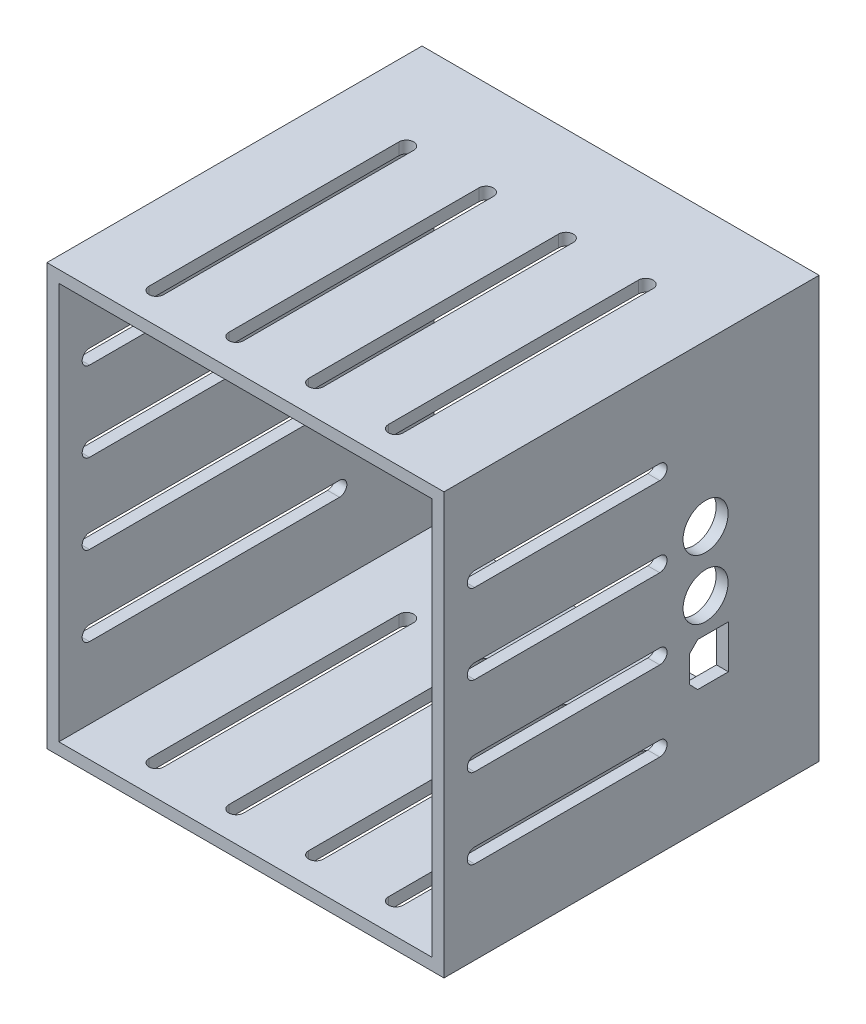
ISO-10303-21;
HEADER;
FILE_DESCRIPTION(('STEP AP214'),'2;1');
FILE_NAME('part.step','',(''),(''),'','','');
FILE_SCHEMA(('AUTOMOTIVE_DESIGN { 1 0 10303 214 1 1 1 1 }'));
ENDSEC;
DATA;
#1=APPLICATION_CONTEXT('core data for automotive mechanical design processes');
#2=APPLICATION_PROTOCOL_DEFINITION('international standard','automotive_design',2000,#1);
#3=PRODUCT_CONTEXT('',#1,'mechanical');
#4=PRODUCT('Part','Part','',(#3));
#5=PRODUCT_RELATED_PRODUCT_CATEGORY('part','',(#4));
#6=PRODUCT_DEFINITION_FORMATION('','',#4);
#7=PRODUCT_DEFINITION_CONTEXT('part definition',#1,'design');
#8=PRODUCT_DEFINITION('design','',#6,#7);
#9=PRODUCT_DEFINITION_SHAPE('','',#8);
#10=(LENGTH_UNIT() NAMED_UNIT(*) SI_UNIT(.MILLI.,.METRE.));
#11=(NAMED_UNIT(*) PLANE_ANGLE_UNIT() SI_UNIT($,.RADIAN.));
#12=(NAMED_UNIT(*) SI_UNIT($,.STERADIAN.) SOLID_ANGLE_UNIT());
#13=UNCERTAINTY_MEASURE_WITH_UNIT(LENGTH_MEASURE(1.E-05),#10,'distance_accuracy_value','');
#14=(GEOMETRIC_REPRESENTATION_CONTEXT(3) GLOBAL_UNCERTAINTY_ASSIGNED_CONTEXT((#13)) GLOBAL_UNIT_ASSIGNED_CONTEXT((#10,
#11,#12)) REPRESENTATION_CONTEXT('',''));
#15=CARTESIAN_POINT('',(0.,0.,0.));
#16=DIRECTION('',(0.,0.,1.));
#17=DIRECTION('',(1.,0.,0.));
#18=AXIS2_PLACEMENT_3D('',#15,#16,#17);
#19=CARTESIAN_POINT('',(-52.75,79.7500000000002,-9039.00737590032));
#20=DIRECTION('',(1.,0.,0.));
#21=DIRECTION('',(0.,0.,-1.));
#22=AXIS2_PLACEMENT_3D('',#19,#20,#21);
#23=PLANE('',#22);
#24=CARTESIAN_POINT('',(-52.75,-2.99999999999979,-9109.32737590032));
#25=DIRECTION('',(-1.,0.,0.));
#26=DIRECTION('',(0.,0.,1.));
#27=AXIS2_PLACEMENT_3D('',#24,#25,#26);
#28=CIRCLE('',#27,1.84);
#29=CARTESIAN_POINT('',(-52.75,-1.15999999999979,-9109.32737590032));
#30=VERTEX_POINT('',#29);
#31=CARTESIAN_POINT('',(-52.75,-4.83999999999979,-9109.32737590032));
#32=VERTEX_POINT('',#31);
#33=EDGE_CURVE('E664',#30,#32,#28,.T.);
#34=ORIENTED_EDGE('',*,*,#33,.F.);
#35=DIRECTION('',(0.,0.,-1.));
#36=VECTOR('',#35,1.);
#37=CARTESIAN_POINT('',(-52.75,-1.15999999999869,0.));
#38=LINE('',#37,#36);
#39=CARTESIAN_POINT('',(-52.75,-1.15999999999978,-9046.68737590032));
#40=VERTEX_POINT('',#39);
#41=EDGE_CURVE('E667',#40,#30,#38,.T.);
#42=ORIENTED_EDGE('',*,*,#41,.F.);
#43=CARTESIAN_POINT('',(-52.75,-2.99999999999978,-9046.68737590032));
#44=DIRECTION('',(-1.,0.,0.));
#45=DIRECTION('',(0.,0.,1.));
#46=AXIS2_PLACEMENT_3D('',#43,#44,#45);
#47=CIRCLE('',#46,1.84);
#48=CARTESIAN_POINT('',(-52.75,-4.83999999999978,-9046.68737590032));
#49=VERTEX_POINT('',#48);
#50=EDGE_CURVE('E655',#40,#49,#47,.F.);
#51=ORIENTED_EDGE('',*,*,#50,.T.);
#52=DIRECTION('',(0.,0.,1.));
#53=VECTOR('',#52,1.);
#54=CARTESIAN_POINT('',(-52.75,-4.83999999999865,0.));
#55=LINE('',#54,#53);
#56=EDGE_CURVE('E660',#32,#49,#55,.T.);
#57=ORIENTED_EDGE('',*,*,#56,.F.);
#58=EDGE_LOOP('',(#34,#42,#51,#57));
#59=FACE_BOUND('',#58,.T.);
#60=CARTESIAN_POINT('',(-52.75,37.0000000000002,-9046.68737590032));
#61=DIRECTION('',(-1.,0.,0.));
#62=DIRECTION('',(0.,0.,1.));
#63=AXIS2_PLACEMENT_3D('',#60,#61,#62);
#64=CIRCLE('',#63,1.84);
#65=CARTESIAN_POINT('',(-52.75,38.8400000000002,-9046.68737590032));
#66=VERTEX_POINT('',#65);
#67=CARTESIAN_POINT('',(-52.75,35.1600000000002,-9046.68737590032));
#68=VERTEX_POINT('',#67);
#69=EDGE_CURVE('E724',#66,#68,#64,.F.);
#70=ORIENTED_EDGE('',*,*,#69,.T.);
#71=DIRECTION('',(0.,0.,1.));
#72=VECTOR('',#71,1.);
#73=CARTESIAN_POINT('',(-52.75,35.1600000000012,0.));
#74=LINE('',#73,#72);
#75=CARTESIAN_POINT('',(-52.75,35.1600000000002,-9109.32737590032));
#76=VERTEX_POINT('',#75);
#77=EDGE_CURVE('E727',#76,#68,#74,.T.);
#78=ORIENTED_EDGE('',*,*,#77,.F.);
#79=CARTESIAN_POINT('',(-52.75,37.0000000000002,-9109.32737590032));
#80=DIRECTION('',(-1.,0.,0.));
#81=DIRECTION('',(0.,0.,1.));
#82=AXIS2_PLACEMENT_3D('',#79,#80,#81);
#83=CIRCLE('',#82,1.84);
#84=CARTESIAN_POINT('',(-52.75,38.8400000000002,-9109.32737590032));
#85=VERTEX_POINT('',#84);
#86=EDGE_CURVE('E731',#85,#76,#83,.T.);
#87=ORIENTED_EDGE('',*,*,#86,.F.);
#88=DIRECTION('',(0.,0.,-1.));
#89=VECTOR('',#88,1.);
#90=CARTESIAN_POINT('',(-52.75,38.8400000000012,0.));
#91=LINE('',#90,#89);
#92=EDGE_CURVE('E734',#66,#85,#91,.T.);
#93=ORIENTED_EDGE('',*,*,#92,.F.);
#94=EDGE_LOOP('',(#70,#78,#87,#93));
#95=FACE_BOUND('',#94,.T.);
#96=DIRECTION('',(0.,-1.,0.));
#97=VECTOR('',#96,1.);
#98=CARTESIAN_POINT('',(-52.75,79.7500000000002,-9133.00737590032));
#99=LINE('',#98,#97);
#100=CARTESIAN_POINT('',(-52.75,79.7500000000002,-9133.00737590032));
#101=VERTEX_POINT('',#100);
#102=CARTESIAN_POINT('',(-52.75,-25.7499999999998,-9133.00737590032));
#103=VERTEX_POINT('',#102);
#104=EDGE_CURVE('E1053',#101,#103,#99,.T.);
#105=ORIENTED_EDGE('',*,*,#104,.T.);
#106=DIRECTION('',(0.,0.,-1.));
#107=VECTOR('',#106,1.);
#108=CARTESIAN_POINT('',(-52.75,-25.7499999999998,-9039.00737590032));
#109=LINE('',#108,#107);
#110=CARTESIAN_POINT('',(-52.75,-25.7499999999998,-9039.00737590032));
#111=VERTEX_POINT('',#110);
#112=EDGE_CURVE('E1080',#111,#103,#109,.T.);
#113=ORIENTED_EDGE('',*,*,#112,.F.);
#114=DIRECTION('',(0.,-1.,0.));
#115=VECTOR('',#114,1.);
#116=CARTESIAN_POINT('',(-52.75,79.7500000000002,-9039.00737590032));
#117=LINE('',#116,#115);
#118=CARTESIAN_POINT('',(-52.75,79.7500000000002,-9039.00737590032));
#119=VERTEX_POINT('',#118);
#120=EDGE_CURVE('E1054',#119,#111,#117,.T.);
#121=ORIENTED_EDGE('',*,*,#120,.F.);
#122=DIRECTION('',(0.,0.,-1.));
#123=VECTOR('',#122,1.);
#124=CARTESIAN_POINT('',(-52.75,79.7500000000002,-9039.00737590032));
#125=LINE('',#124,#123);
#126=EDGE_CURVE('E1064',#119,#101,#125,.T.);
#127=ORIENTED_EDGE('',*,*,#126,.T.);
#128=EDGE_LOOP('',(#105,#113,#121,#127));
#129=FACE_BOUND('',#128,.T.);
#130=CARTESIAN_POINT('',(-52.75,57.0000000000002,-9109.32737590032));
#131=DIRECTION('',(-1.,0.,0.));
#132=DIRECTION('',(0.,0.,1.));
#133=AXIS2_PLACEMENT_3D('',#130,#131,#132);
#134=CIRCLE('',#133,1.84);
#135=CARTESIAN_POINT('',(-52.75,55.1600000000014,-9109.32737590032));
#136=VERTEX_POINT('',#135);
#137=CARTESIAN_POINT('',(-52.75,58.8400000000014,-9109.32737590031));
#138=VERTEX_POINT('',#137);
#139=EDGE_CURVE('E758',#136,#138,#134,.F.);
#140=ORIENTED_EDGE('',*,*,#139,.T.);
#141=DIRECTION('',(0.,0.,-1.));
#142=VECTOR('',#141,1.);
#143=CARTESIAN_POINT('',(-52.75,58.8400000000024,0.));
#144=LINE('',#143,#142);
#145=CARTESIAN_POINT('',(-52.75,58.8400000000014,-9046.68737590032));
#146=VERTEX_POINT('',#145);
#147=EDGE_CURVE('E748',#146,#138,#144,.T.);
#148=ORIENTED_EDGE('',*,*,#147,.F.);
#149=CARTESIAN_POINT('',(-52.75,57.0000000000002,-9046.68737590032));
#150=DIRECTION('',(-1.,0.,0.));
#151=DIRECTION('',(0.,0.,1.));
#152=AXIS2_PLACEMENT_3D('',#149,#150,#151);
#153=CIRCLE('',#152,1.84);
#154=CARTESIAN_POINT('',(-52.75,55.1600000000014,-9046.68737590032));
#155=VERTEX_POINT('',#154);
#156=EDGE_CURVE('E752',#155,#146,#153,.T.);
#157=ORIENTED_EDGE('',*,*,#156,.F.);
#158=DIRECTION('',(0.,0.,1.));
#159=VECTOR('',#158,1.);
#160=CARTESIAN_POINT('',(-52.75,55.1600000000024,0.));
#161=LINE('',#160,#159);
#162=EDGE_CURVE('E755',#136,#155,#161,.T.);
#163=ORIENTED_EDGE('',*,*,#162,.F.);
#164=EDGE_LOOP('',(#140,#148,#157,#163));
#165=FACE_BOUND('',#164,.T.);
#166=CARTESIAN_POINT('',(-52.75,17.0000000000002,-9046.68737590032));
#167=DIRECTION('',(-1.,0.,0.));
#168=DIRECTION('',(0.,0.,1.));
#169=AXIS2_PLACEMENT_3D('',#166,#167,#168);
#170=CIRCLE('',#169,1.84);
#171=CARTESIAN_POINT('',(-52.75,18.8400000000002,-9046.68737590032));
#172=VERTEX_POINT('',#171);
#173=CARTESIAN_POINT('',(-52.75,15.1600000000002,-9046.68737590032));
#174=VERTEX_POINT('',#173);
#175=EDGE_CURVE('E688',#172,#174,#170,.F.);
#176=ORIENTED_EDGE('',*,*,#175,.T.);
#177=DIRECTION('',(0.,0.,1.));
#178=VECTOR('',#177,1.);
#179=CARTESIAN_POINT('',(-52.75,15.1600000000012,0.));
#180=LINE('',#179,#178);
#181=CARTESIAN_POINT('',(-52.75,15.1600000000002,-9109.32737590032));
#182=VERTEX_POINT('',#181);
#183=EDGE_CURVE('E692',#182,#174,#180,.T.);
#184=ORIENTED_EDGE('',*,*,#183,.F.);
#185=CARTESIAN_POINT('',(-52.75,17.0000000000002,-9109.32737590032));
#186=DIRECTION('',(-1.,0.,0.));
#187=DIRECTION('',(0.,0.,1.));
#188=AXIS2_PLACEMENT_3D('',#185,#186,#187);
#189=CIRCLE('',#188,1.84);
#190=CARTESIAN_POINT('',(-52.75,18.8400000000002,-9109.32737590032));
#191=VERTEX_POINT('',#190);
#192=EDGE_CURVE('E696',#191,#182,#189,.T.);
#193=ORIENTED_EDGE('',*,*,#192,.F.);
#194=DIRECTION('',(0.,0.,-1.));
#195=VECTOR('',#194,1.);
#196=CARTESIAN_POINT('',(-52.75,18.8400000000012,0.));
#197=LINE('',#196,#195);
#198=EDGE_CURVE('E687',#172,#191,#197,.T.);
#199=ORIENTED_EDGE('',*,*,#198,.F.);
#200=EDGE_LOOP('',(#176,#184,#193,#199));
#201=FACE_BOUND('',#200,.T.);
#202=ADVANCED_FACE('F35',(#59,#95,#129,#165,#201),#23,.F.);
#203=CARTESIAN_POINT('',(-49.75,76.7500000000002,-9039.00737590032));
#204=DIRECTION('',(1.,0.,0.));
#205=DIRECTION('',(0.,1.,0.));
#206=AXIS2_PLACEMENT_3D('',#203,#204,#205);
#207=PLANE('',#206);
#208=DIRECTION('',(0.,0.,-1.));
#209=VECTOR('',#208,1.);
#210=CARTESIAN_POINT('',(-49.75,-1.15999999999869,0.));
#211=LINE('',#210,#209);
#212=CARTESIAN_POINT('',(-49.75,-1.15999999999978,-9046.68737590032));
#213=VERTEX_POINT('',#212);
#214=CARTESIAN_POINT('',(-49.75,-1.15999999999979,-9109.32737590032));
#215=VERTEX_POINT('',#214);
#216=EDGE_CURVE('E649',#213,#215,#211,.T.);
#217=ORIENTED_EDGE('',*,*,#216,.T.);
#218=CARTESIAN_POINT('',(-49.75,-2.99999999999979,-9109.32737590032));
#219=DIRECTION('',(1.,0.,0.));
#220=DIRECTION('',(0.,1.,0.));
#221=AXIS2_PLACEMENT_3D('',#218,#219,#220);
#222=CIRCLE('',#221,1.84);
#223=CARTESIAN_POINT('',(-49.75,-4.83999999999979,-9109.32737590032));
#224=VERTEX_POINT('',#223);
#225=EDGE_CURVE('E650',#215,#224,#222,.F.);
#226=ORIENTED_EDGE('',*,*,#225,.T.);
#227=DIRECTION('',(0.,0.,1.));
#228=VECTOR('',#227,1.);
#229=CARTESIAN_POINT('',(-49.75,-4.83999999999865,0.));
#230=LINE('',#229,#228);
#231=CARTESIAN_POINT('',(-49.75,-4.83999999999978,-9046.68737590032));
#232=VERTEX_POINT('',#231);
#233=EDGE_CURVE('E658',#224,#232,#230,.T.);
#234=ORIENTED_EDGE('',*,*,#233,.T.);
#235=CARTESIAN_POINT('',(-49.75,-2.99999999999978,-9046.68737590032));
#236=DIRECTION('',(1.,0.,0.));
#237=DIRECTION('',(0.,1.,0.));
#238=AXIS2_PLACEMENT_3D('',#235,#236,#237);
#239=CIRCLE('',#238,1.84);
#240=EDGE_CURVE('E663',#213,#232,#239,.T.);
#241=ORIENTED_EDGE('',*,*,#240,.F.);
#242=EDGE_LOOP('',(#217,#226,#234,#241));
#243=FACE_BOUND('',#242,.T.);
#244=DIRECTION('',(0.,-1.,0.));
#245=VECTOR('',#244,1.);
#246=CARTESIAN_POINT('',(-49.75,76.7500000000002,-9133.00737590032));
#247=LINE('',#246,#245);
#248=CARTESIAN_POINT('',(-49.75,76.7500000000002,-9133.00737590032));
#249=VERTEX_POINT('',#248);
#250=CARTESIAN_POINT('',(-49.75,-22.7499999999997,-9133.00737590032));
#251=VERTEX_POINT('',#250);
#252=EDGE_CURVE('E1022',#249,#251,#247,.T.);
#253=ORIENTED_EDGE('',*,*,#252,.F.);
#254=DIRECTION('',(0.,0.,-1.));
#255=VECTOR('',#254,1.);
#256=CARTESIAN_POINT('',(-49.75,76.7500000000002,-9039.00737590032));
#257=LINE('',#256,#255);
#258=CARTESIAN_POINT('',(-49.75,76.7500000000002,-9039.00737590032));
#259=VERTEX_POINT('',#258);
#260=EDGE_CURVE('E1033',#259,#249,#257,.T.);
#261=ORIENTED_EDGE('',*,*,#260,.F.);
#262=DIRECTION('',(0.,-1.,0.));
#263=VECTOR('',#262,1.);
#264=CARTESIAN_POINT('',(-49.75,76.7500000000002,-9039.00737590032));
#265=LINE('',#264,#263);
#266=CARTESIAN_POINT('',(-49.75,-22.7499999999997,-9039.00737590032));
#267=VERTEX_POINT('',#266);
#268=EDGE_CURVE('E1023',#259,#267,#265,.T.);
#269=ORIENTED_EDGE('',*,*,#268,.T.);
#270=DIRECTION('',(0.,0.,-1.));
#271=VECTOR('',#270,1.);
#272=CARTESIAN_POINT('',(-49.75,-22.7499999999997,-9039.00737590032));
#273=LINE('',#272,#271);
#274=EDGE_CURVE('E1050',#267,#251,#273,.T.);
#275=ORIENTED_EDGE('',*,*,#274,.T.);
#276=EDGE_LOOP('',(#253,#261,#269,#275));
#277=FACE_BOUND('',#276,.T.);
#278=DIRECTION('',(0.,0.,-1.));
#279=VECTOR('',#278,1.);
#280=CARTESIAN_POINT('',(-49.75,58.8400000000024,0.));
#281=LINE('',#280,#279);
#282=CARTESIAN_POINT('',(-49.75,58.8400000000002,-9046.68737590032));
#283=VERTEX_POINT('',#282);
#284=CARTESIAN_POINT('',(-49.75,58.8400000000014,-9109.32737590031));
#285=VERTEX_POINT('',#284);
#286=EDGE_CURVE('E761',#283,#285,#281,.T.);
#287=ORIENTED_EDGE('',*,*,#286,.T.);
#288=CARTESIAN_POINT('',(-49.75,57.0000000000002,-9109.32737590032));
#289=DIRECTION('',(1.,0.,0.));
#290=DIRECTION('',(0.,1.,0.));
#291=AXIS2_PLACEMENT_3D('',#288,#289,#290);
#292=CIRCLE('',#291,1.84);
#293=CARTESIAN_POINT('',(-49.75,55.1600000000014,-9109.32737590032));
#294=VERTEX_POINT('',#293);
#295=EDGE_CURVE('E751',#294,#285,#292,.T.);
#296=ORIENTED_EDGE('',*,*,#295,.F.);
#297=DIRECTION('',(0.,0.,1.));
#298=VECTOR('',#297,1.);
#299=CARTESIAN_POINT('',(-49.75,55.1600000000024,0.));
#300=LINE('',#299,#298);
#301=CARTESIAN_POINT('',(-49.75,55.1600000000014,-9046.68737590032));
#302=VERTEX_POINT('',#301);
#303=EDGE_CURVE('E743',#294,#302,#300,.T.);
#304=ORIENTED_EDGE('',*,*,#303,.T.);
#305=CARTESIAN_POINT('',(-49.75,57.0000000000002,-9046.68737590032));
#306=DIRECTION('',(1.,0.,0.));
#307=DIRECTION('',(0.,1.,0.));
#308=AXIS2_PLACEMENT_3D('',#305,#306,#307);
#309=CIRCLE('',#308,1.84);
#310=EDGE_CURVE('E767',#302,#283,#309,.F.);
#311=ORIENTED_EDGE('',*,*,#310,.T.);
#312=EDGE_LOOP('',(#287,#296,#304,#311));
#313=FACE_BOUND('',#312,.T.);
#314=DIRECTION('',(0.,0.,1.));
#315=VECTOR('',#314,1.);
#316=CARTESIAN_POINT('',(-49.75,35.1600000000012,0.));
#317=LINE('',#316,#315);
#318=CARTESIAN_POINT('',(-49.75,35.1600000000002,-9109.32737590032));
#319=VERTEX_POINT('',#318);
#320=CARTESIAN_POINT('',(-49.75,35.1600000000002,-9046.68737590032));
#321=VERTEX_POINT('',#320);
#322=EDGE_CURVE('E720',#319,#321,#317,.T.);
#323=ORIENTED_EDGE('',*,*,#322,.T.);
#324=CARTESIAN_POINT('',(-49.75,37.0000000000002,-9046.68737590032));
#325=DIRECTION('',(1.,0.,0.));
#326=DIRECTION('',(0.,1.,0.));
#327=AXIS2_PLACEMENT_3D('',#324,#325,#326);
#328=CIRCLE('',#327,1.84);
#329=CARTESIAN_POINT('',(-49.75,38.8400000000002,-9046.68737590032));
#330=VERTEX_POINT('',#329);
#331=EDGE_CURVE('E730',#330,#321,#328,.T.);
#332=ORIENTED_EDGE('',*,*,#331,.F.);
#333=DIRECTION('',(0.,0.,-1.));
#334=VECTOR('',#333,1.);
#335=CARTESIAN_POINT('',(-49.75,38.8400000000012,0.));
#336=LINE('',#335,#334);
#337=CARTESIAN_POINT('',(-49.75,38.8400000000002,-9109.32737590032));
#338=VERTEX_POINT('',#337);
#339=EDGE_CURVE('E721',#330,#338,#336,.T.);
#340=ORIENTED_EDGE('',*,*,#339,.T.);
#341=CARTESIAN_POINT('',(-49.75,37.0000000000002,-9109.32737590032));
#342=DIRECTION('',(1.,0.,0.));
#343=DIRECTION('',(0.,1.,0.));
#344=AXIS2_PLACEMENT_3D('',#341,#342,#343);
#345=CIRCLE('',#344,1.84);
#346=EDGE_CURVE('E712',#338,#319,#345,.F.);
#347=ORIENTED_EDGE('',*,*,#346,.T.);
#348=EDGE_LOOP('',(#323,#332,#340,#347));
#349=FACE_BOUND('',#348,.T.);
#350=DIRECTION('',(0.,0.,1.));
#351=VECTOR('',#350,1.);
#352=CARTESIAN_POINT('',(-49.75,15.1600000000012,0.));
#353=LINE('',#352,#351);
#354=CARTESIAN_POINT('',(-49.75,15.1600000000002,-9109.32737590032));
#355=VERTEX_POINT('',#354);
#356=CARTESIAN_POINT('',(-49.75,15.1600000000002,-9046.68737590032));
#357=VERTEX_POINT('',#356);
#358=EDGE_CURVE('E705',#355,#357,#353,.T.);
#359=ORIENTED_EDGE('',*,*,#358,.T.);
#360=CARTESIAN_POINT('',(-49.75,17.0000000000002,-9046.68737590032));
#361=DIRECTION('',(1.,0.,0.));
#362=DIRECTION('',(0.,1.,0.));
#363=AXIS2_PLACEMENT_3D('',#360,#361,#362);
#364=CIRCLE('',#363,1.84);
#365=CARTESIAN_POINT('',(-49.75,18.8400000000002,-9046.68737590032));
#366=VERTEX_POINT('',#365);
#367=EDGE_CURVE('E695',#366,#357,#364,.T.);
#368=ORIENTED_EDGE('',*,*,#367,.F.);
#369=DIRECTION('',(0.,0.,-1.));
#370=VECTOR('',#369,1.);
#371=CARTESIAN_POINT('',(-49.75,18.8400000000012,0.));
#372=LINE('',#371,#370);
#373=CARTESIAN_POINT('',(-49.75,18.8400000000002,-9109.32737590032));
#374=VERTEX_POINT('',#373);
#375=EDGE_CURVE('E691',#366,#374,#372,.T.);
#376=ORIENTED_EDGE('',*,*,#375,.T.);
#377=CARTESIAN_POINT('',(-49.75,17.0000000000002,-9109.32737590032));
#378=DIRECTION('',(1.,0.,0.));
#379=DIRECTION('',(0.,1.,0.));
#380=AXIS2_PLACEMENT_3D('',#377,#378,#379);
#381=CIRCLE('',#380,1.84);
#382=EDGE_CURVE('E681',#374,#355,#381,.F.);
#383=ORIENTED_EDGE('',*,*,#382,.T.);
#384=EDGE_LOOP('',(#359,#368,#376,#383));
#385=FACE_BOUND('',#384,.T.);
#386=ADVANCED_FACE('F1175',(#243,#277,#313,#349,#385),#207,.T.);
#387=CARTESIAN_POINT('',(0.,0.,-9039.00737590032));
#388=DIRECTION('',(0.,0.,1.));
#389=DIRECTION('',(1.,0.,0.));
#390=AXIS2_PLACEMENT_3D('',#387,#388,#389);
#391=PLANE('',#390);
#392=ORIENTED_EDGE('',*,*,#120,.T.);
#393=DIRECTION('',(1.,0.,0.));
#394=VECTOR('',#393,1.);
#395=CARTESIAN_POINT('',(-52.75,-25.7499999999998,-9039.00737590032));
#396=LINE('',#395,#394);
#397=CARTESIAN_POINT('',(46.75,-25.7499999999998,-9039.00737590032));
#398=VERTEX_POINT('',#397);
#399=EDGE_CURVE('E1057',#111,#398,#396,.T.);
#400=ORIENTED_EDGE('',*,*,#399,.T.);
#401=DIRECTION('',(0.,1.,0.));
#402=VECTOR('',#401,1.);
#403=CARTESIAN_POINT('',(46.75,79.7500000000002,-9039.00737590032));
#404=LINE('',#403,#402);
#405=CARTESIAN_POINT('',(46.75,79.7500000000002,-9039.00737590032));
#406=VERTEX_POINT('',#405);
#407=EDGE_CURVE('E1060',#398,#406,#404,.T.);
#408=ORIENTED_EDGE('',*,*,#407,.T.);
#409=DIRECTION('',(-1.,0.,0.));
#410=VECTOR('',#409,1.);
#411=CARTESIAN_POINT('',(-52.75,79.7500000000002,-9039.00737590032));
#412=LINE('',#411,#410);
#413=EDGE_CURVE('E1062',#406,#119,#412,.T.);
#414=ORIENTED_EDGE('',*,*,#413,.T.);
#415=EDGE_LOOP('',(#392,#400,#408,#414));
#416=FACE_BOUND('',#415,.T.);
#417=DIRECTION('',(1.,0.,0.));
#418=VECTOR('',#417,1.);
#419=CARTESIAN_POINT('',(-49.75,-22.7499999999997,-9039.00737590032));
#420=LINE('',#419,#418);
#421=CARTESIAN_POINT('',(43.7499999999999,-22.7499999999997,-9039.00737590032));
#422=VERTEX_POINT('',#421);
#423=EDGE_CURVE('E1025',#267,#422,#420,.T.);
#424=ORIENTED_EDGE('',*,*,#423,.F.);
#425=ORIENTED_EDGE('',*,*,#268,.F.);
#426=DIRECTION('',(-1.,0.,0.));
#427=VECTOR('',#426,1.);
#428=CARTESIAN_POINT('',(-49.75,76.7500000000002,-9039.00737590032));
#429=LINE('',#428,#427);
#430=CARTESIAN_POINT('',(43.7499999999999,76.7500000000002,-9039.00737590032));
#431=VERTEX_POINT('',#430);
#432=EDGE_CURVE('E1031',#431,#259,#429,.T.);
#433=ORIENTED_EDGE('',*,*,#432,.F.);
#434=DIRECTION('',(0.,1.,0.));
#435=VECTOR('',#434,1.);
#436=CARTESIAN_POINT('',(43.7499999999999,76.7500000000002,-9039.00737590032));
#437=LINE('',#436,#435);
#438=EDGE_CURVE('E1028',#422,#431,#437,.T.);
#439=ORIENTED_EDGE('',*,*,#438,.F.);
#440=EDGE_LOOP('',(#424,#425,#433,#439));
#441=FACE_BOUND('',#440,.T.);
#442=ADVANCED_FACE('F1163',(#416,#441),#391,.T.);
#443=CARTESIAN_POINT('',(0.,0.,-9133.00737590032));
#444=DIRECTION('',(0.,0.,1.));
#445=DIRECTION('',(1.,0.,0.));
#446=AXIS2_PLACEMENT_3D('',#443,#444,#445);
#447=PLANE('',#446);
#448=ORIENTED_EDGE('',*,*,#104,.F.);
#449=DIRECTION('',(-1.,0.,0.));
#450=VECTOR('',#449,1.);
#451=CARTESIAN_POINT('',(-52.75,79.7500000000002,-9133.00737590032));
#452=LINE('',#451,#450);
#453=CARTESIAN_POINT('',(46.75,79.7500000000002,-9133.00737590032));
#454=VERTEX_POINT('',#453);
#455=EDGE_CURVE('E1058',#454,#101,#452,.T.);
#456=ORIENTED_EDGE('',*,*,#455,.F.);
#457=DIRECTION('',(0.,1.,0.));
#458=VECTOR('',#457,1.);
#459=CARTESIAN_POINT('',(46.75,79.7500000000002,-9133.00737590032));
#460=LINE('',#459,#458);
#461=CARTESIAN_POINT('',(46.75,-25.7499999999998,-9133.00737590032));
#462=VERTEX_POINT('',#461);
#463=EDGE_CURVE('E1069',#462,#454,#460,.T.);
#464=ORIENTED_EDGE('',*,*,#463,.F.);
#465=DIRECTION('',(1.,0.,0.));
#466=VECTOR('',#465,1.);
#467=CARTESIAN_POINT('',(-52.75,-25.7499999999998,-9133.00737590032));
#468=LINE('',#467,#466);
#469=EDGE_CURVE('E1067',#103,#462,#468,.T.);
#470=ORIENTED_EDGE('',*,*,#469,.F.);
#471=EDGE_LOOP('',(#448,#456,#464,#470));
#472=FACE_BOUND('',#471,.T.);
#473=ORIENTED_EDGE('',*,*,#252,.T.);
#474=DIRECTION('',(1.,0.,0.));
#475=VECTOR('',#474,1.);
#476=CARTESIAN_POINT('',(-49.75,-22.7499999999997,-9133.00737590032));
#477=LINE('',#476,#475);
#478=CARTESIAN_POINT('',(43.7499999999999,-22.7499999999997,-9133.00737590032));
#479=VERTEX_POINT('',#478);
#480=EDGE_CURVE('E1036',#251,#479,#477,.T.);
#481=ORIENTED_EDGE('',*,*,#480,.T.);
#482=DIRECTION('',(0.,1.,0.));
#483=VECTOR('',#482,1.);
#484=CARTESIAN_POINT('',(43.7499999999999,76.7500000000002,-9133.00737590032));
#485=LINE('',#484,#483);
#486=CARTESIAN_POINT('',(43.7499999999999,76.7500000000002,-9133.00737590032));
#487=VERTEX_POINT('',#486);
#488=EDGE_CURVE('E1039',#479,#487,#485,.T.);
#489=ORIENTED_EDGE('',*,*,#488,.T.);
#490=DIRECTION('',(-1.,0.,0.));
#491=VECTOR('',#490,1.);
#492=CARTESIAN_POINT('',(-49.75,76.7500000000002,-9133.00737590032));
#493=LINE('',#492,#491);
#494=EDGE_CURVE('E1026',#487,#249,#493,.T.);
#495=ORIENTED_EDGE('',*,*,#494,.T.);
#496=EDGE_LOOP('',(#473,#481,#489,#495));
#497=FACE_BOUND('',#496,.T.);
#498=ADVANCED_FACE('F1156',(#472,#497),#447,.F.);
#499=CARTESIAN_POINT('',(-52.75,-25.7499999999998,-9039.00737590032));
#500=DIRECTION('',(0.,1.,0.));
#501=DIRECTION('',(0.,0.,1.));
#502=AXIS2_PLACEMENT_3D('',#499,#500,#501);
#503=PLANE('',#502);
#504=DIRECTION('',(0.,0.,-1.));
#505=VECTOR('',#504,1.);
#506=CARTESIAN_POINT('',(25.16,-25.7499999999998,-9046.68737590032));
#507=LINE('',#506,#505);
#508=CARTESIAN_POINT('',(25.16,-25.7499999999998,-9046.68737590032));
#509=VERTEX_POINT('',#508);
#510=CARTESIAN_POINT('',(25.16,-25.7499999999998,-9109.32737590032));
#511=VERTEX_POINT('',#510);
#512=EDGE_CURVE('E790',#509,#511,#507,.T.);
#513=ORIENTED_EDGE('',*,*,#512,.F.);
#514=CARTESIAN_POINT('',(27.,-25.7499999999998,-9046.68737590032));
#515=DIRECTION('',(0.,-1.,0.));
#516=DIRECTION('',(0.,0.,1.));
#517=AXIS2_PLACEMENT_3D('',#514,#515,#516);
#518=CIRCLE('',#517,1.84);
#519=CARTESIAN_POINT('',(28.84,-25.7499999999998,-9046.68737590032));
#520=VERTEX_POINT('',#519);
#521=EDGE_CURVE('E763',#520,#509,#518,.T.);
#522=ORIENTED_EDGE('',*,*,#521,.F.);
#523=DIRECTION('',(0.,0.,1.));
#524=VECTOR('',#523,1.);
#525=CARTESIAN_POINT('',(28.84,-25.7499999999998,-9109.32737590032));
#526=LINE('',#525,#524);
#527=CARTESIAN_POINT('',(28.84,-25.7499999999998,-9109.32737590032));
#528=VERTEX_POINT('',#527);
#529=EDGE_CURVE('E779',#528,#520,#526,.T.);
#530=ORIENTED_EDGE('',*,*,#529,.F.);
#531=CARTESIAN_POINT('',(27.,-25.7499999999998,-9109.32737590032));
#532=DIRECTION('',(0.,-1.,0.));
#533=DIRECTION('',(0.,0.,-1.));
#534=AXIS2_PLACEMENT_3D('',#531,#532,#533);
#535=CIRCLE('',#534,1.84);
#536=EDGE_CURVE('E793',#511,#528,#535,.T.);
#537=ORIENTED_EDGE('',*,*,#536,.F.);
#538=EDGE_LOOP('',(#513,#522,#530,#537));
#539=FACE_BOUND('',#538,.T.);
#540=DIRECTION('',(0.,0.,-1.));
#541=VECTOR('',#540,1.);
#542=CARTESIAN_POINT('',(5.15999999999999,-25.7499999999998,-9046.68737590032));
#543=LINE('',#542,#541);
#544=CARTESIAN_POINT('',(5.15999999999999,-25.7499999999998,-9046.68737590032));
#545=VERTEX_POINT('',#544);
#546=CARTESIAN_POINT('',(5.15999999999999,-25.7499999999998,-9109.32737590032));
#547=VERTEX_POINT('',#546);
#548=EDGE_CURVE('E837',#545,#547,#543,.T.);
#549=ORIENTED_EDGE('',*,*,#548,.F.);
#550=CARTESIAN_POINT('',(6.99999999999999,-25.7499999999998,-9046.68737590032));
#551=DIRECTION('',(0.,-1.,0.));
#552=DIRECTION('',(0.,0.,1.));
#553=AXIS2_PLACEMENT_3D('',#550,#551,#552);
#554=CIRCLE('',#553,1.84);
#555=CARTESIAN_POINT('',(8.83999999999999,-25.7499999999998,-9046.68737590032));
#556=VERTEX_POINT('',#555);
#557=EDGE_CURVE('E821',#556,#545,#554,.T.);
#558=ORIENTED_EDGE('',*,*,#557,.F.);
#559=DIRECTION('',(0.,0.,1.));
#560=VECTOR('',#559,1.);
#561=CARTESIAN_POINT('',(8.83999999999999,-25.7499999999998,-9109.32737590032));
#562=LINE('',#561,#560);
#563=CARTESIAN_POINT('',(8.83999999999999,-25.7499999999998,-9109.32737590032));
#564=VERTEX_POINT('',#563);
#565=EDGE_CURVE('E826',#564,#556,#562,.T.);
#566=ORIENTED_EDGE('',*,*,#565,.F.);
#567=CARTESIAN_POINT('',(6.99999999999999,-25.7499999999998,-9109.32737590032));
#568=DIRECTION('',(0.,-1.,0.));
#569=DIRECTION('',(0.,0.,1.));
#570=AXIS2_PLACEMENT_3D('',#567,#568,#569);
#571=CIRCLE('',#570,1.84);
#572=EDGE_CURVE('E840',#547,#564,#571,.T.);
#573=ORIENTED_EDGE('',*,*,#572,.F.);
#574=EDGE_LOOP('',(#549,#558,#566,#573));
#575=FACE_BOUND('',#574,.T.);
#576=DIRECTION('',(0.,0.,-1.));
#577=VECTOR('',#576,1.);
#578=CARTESIAN_POINT('',(-14.84,-25.7499999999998,-9046.68737590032));
#579=LINE('',#578,#577);
#580=CARTESIAN_POINT('',(-14.84,-25.7499999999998,-9046.68737590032));
#581=VERTEX_POINT('',#580);
#582=CARTESIAN_POINT('',(-14.84,-25.7499999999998,-9109.32737590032));
#583=VERTEX_POINT('',#582);
#584=EDGE_CURVE('E884',#581,#583,#579,.T.);
#585=ORIENTED_EDGE('',*,*,#584,.F.);
#586=CARTESIAN_POINT('',(-13.,-25.7499999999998,-9046.68737590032));
#587=DIRECTION('',(0.,-1.,0.));
#588=DIRECTION('',(0.,0.,1.));
#589=AXIS2_PLACEMENT_3D('',#586,#587,#588);
#590=CIRCLE('',#589,1.84);
#591=CARTESIAN_POINT('',(-11.16,-25.7499999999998,-9046.68737590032));
#592=VERTEX_POINT('',#591);
#593=EDGE_CURVE('E868',#592,#581,#590,.T.);
#594=ORIENTED_EDGE('',*,*,#593,.F.);
#595=DIRECTION('',(0.,0.,1.));
#596=VECTOR('',#595,1.);
#597=CARTESIAN_POINT('',(-11.16,-25.7499999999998,-9109.32737590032));
#598=LINE('',#597,#596);
#599=CARTESIAN_POINT('',(-11.16,-25.7499999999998,-9109.32737590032));
#600=VERTEX_POINT('',#599);
#601=EDGE_CURVE('E873',#600,#592,#598,.T.);
#602=ORIENTED_EDGE('',*,*,#601,.F.);
#603=CARTESIAN_POINT('',(-13.,-25.7499999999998,-9109.32737590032));
#604=DIRECTION('',(0.,-1.,0.));
#605=DIRECTION('',(0.,0.,1.));
#606=AXIS2_PLACEMENT_3D('',#603,#604,#605);
#607=CIRCLE('',#606,1.84);
#608=EDGE_CURVE('E887',#583,#600,#607,.T.);
#609=ORIENTED_EDGE('',*,*,#608,.F.);
#610=EDGE_LOOP('',(#585,#594,#602,#609));
#611=FACE_BOUND('',#610,.T.);
#612=DIRECTION('',(0.,0.,-1.));
#613=VECTOR('',#612,1.);
#614=CARTESIAN_POINT('',(-34.84,-25.7499999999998,-9046.68737590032));
#615=LINE('',#614,#613);
#616=CARTESIAN_POINT('',(-34.84,-25.7499999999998,-9046.68737590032));
#617=VERTEX_POINT('',#616);
#618=CARTESIAN_POINT('',(-34.84,-25.7499999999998,-9109.32737590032));
#619=VERTEX_POINT('',#618);
#620=EDGE_CURVE('E931',#617,#619,#615,.T.);
#621=ORIENTED_EDGE('',*,*,#620,.F.);
#622=CARTESIAN_POINT('',(-33.,-25.7499999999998,-9046.68737590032));
#623=DIRECTION('',(0.,-1.,0.));
#624=DIRECTION('',(0.,0.,-1.));
#625=AXIS2_PLACEMENT_3D('',#622,#623,#624);
#626=CIRCLE('',#625,1.84);
#627=CARTESIAN_POINT('',(-31.16,-25.7499999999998,-9046.68737590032));
#628=VERTEX_POINT('',#627);
#629=EDGE_CURVE('E915',#628,#617,#626,.T.);
#630=ORIENTED_EDGE('',*,*,#629,.F.);
#631=DIRECTION('',(0.,0.,1.));
#632=VECTOR('',#631,1.);
#633=CARTESIAN_POINT('',(-31.16,-25.7499999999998,-9109.32737590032));
#634=LINE('',#633,#632);
#635=CARTESIAN_POINT('',(-31.16,-25.7499999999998,-9109.32737590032));
#636=VERTEX_POINT('',#635);
#637=EDGE_CURVE('E920',#636,#628,#634,.T.);
#638=ORIENTED_EDGE('',*,*,#637,.F.);
#639=CARTESIAN_POINT('',(-33.,-25.7499999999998,-9109.32737590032));
#640=DIRECTION('',(0.,-1.,0.));
#641=DIRECTION('',(0.,0.,1.));
#642=AXIS2_PLACEMENT_3D('',#639,#640,#641);
#643=CIRCLE('',#642,1.84);
#644=EDGE_CURVE('E934',#619,#636,#643,.T.);
#645=ORIENTED_EDGE('',*,*,#644,.F.);
#646=EDGE_LOOP('',(#621,#630,#638,#645));
#647=FACE_BOUND('',#646,.T.);
#648=ORIENTED_EDGE('',*,*,#469,.T.);
#649=DIRECTION('',(0.,0.,-1.));
#650=VECTOR('',#649,1.);
#651=CARTESIAN_POINT('',(46.75,-25.7499999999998,-9039.00737590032));
#652=LINE('',#651,#650);
#653=EDGE_CURVE('E1077',#398,#462,#652,.T.);
#654=ORIENTED_EDGE('',*,*,#653,.F.);
#655=ORIENTED_EDGE('',*,*,#399,.F.);
#656=ORIENTED_EDGE('',*,*,#112,.T.);
#657=EDGE_LOOP('',(#648,#654,#655,#656));
#658=FACE_BOUND('',#657,.T.);
#659=ADVANCED_FACE('F1160',(#539,#575,#611,#647,#658),#503,.F.);
#660=CARTESIAN_POINT('',(46.75,79.7500000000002,-9039.00737590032));
#661=DIRECTION('',(-1.,0.,0.));
#662=DIRECTION('',(0.,0.,1.));
#663=AXIS2_PLACEMENT_3D('',#660,#661,#662);
#664=PLANE('',#663);
#665=DIRECTION('',(0.,0.,-1.));
#666=VECTOR('',#665,1.);
#667=CARTESIAN_POINT('',(46.75,55.1600000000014,-9046.68737590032));
#668=LINE('',#667,#666);
#669=CARTESIAN_POINT('',(46.75,55.1600000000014,-9046.68737590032));
#670=VERTEX_POINT('',#669);
#671=CARTESIAN_POINT('',(46.75,55.1600000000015,-9093.07287590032));
#672=VERTEX_POINT('',#671);
#673=EDGE_CURVE('E538',#670,#672,#668,.T.);
#674=ORIENTED_EDGE('',*,*,#673,.F.);
#675=CARTESIAN_POINT('',(46.75,57.0000000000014,-9046.68737590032));
#676=DIRECTION('',(1.,0.,0.));
#677=DIRECTION('',(0.,0.,-1.));
#678=AXIS2_PLACEMENT_3D('',#675,#676,#677);
#679=CIRCLE('',#678,1.84);
#680=CARTESIAN_POINT('',(46.75,58.8400000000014,-9046.68737590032));
#681=VERTEX_POINT('',#680);
#682=EDGE_CURVE('E49',#681,#670,#679,.T.);
#683=ORIENTED_EDGE('',*,*,#682,.F.);
#684=DIRECTION('',(0.,0.,1.));
#685=VECTOR('',#684,1.);
#686=CARTESIAN_POINT('',(46.75,58.8400000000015,-9093.07287590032));
#687=LINE('',#686,#685);
#688=CARTESIAN_POINT('',(46.75,58.8400000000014,-9093.07287590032));
#689=VERTEX_POINT('',#688);
#690=EDGE_CURVE('E531',#689,#681,#687,.T.);
#691=ORIENTED_EDGE('',*,*,#690,.F.);
#692=CARTESIAN_POINT('',(46.75,57.0000000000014,-9093.07287590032));
#693=DIRECTION('',(1.,0.,0.));
#694=DIRECTION('',(0.,0.,-1.));
#695=AXIS2_PLACEMENT_3D('',#692,#693,#694);
#696=CIRCLE('',#695,1.84);
#697=EDGE_CURVE('E545',#672,#689,#696,.T.);
#698=ORIENTED_EDGE('',*,*,#697,.F.);
#699=EDGE_LOOP('',(#674,#683,#691,#698));
#700=FACE_BOUND('',#699,.T.);
#701=DIRECTION('',(0.,0.,-1.));
#702=VECTOR('',#701,1.);
#703=CARTESIAN_POINT('',(46.75,35.1600000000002,-9046.68737590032));
#704=LINE('',#703,#702);
#705=CARTESIAN_POINT('',(46.75,35.1600000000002,-9046.68737590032));
#706=VERTEX_POINT('',#705);
#707=CARTESIAN_POINT('',(46.75,35.1600000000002,-9093.07287590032));
#708=VERTEX_POINT('',#707);
#709=EDGE_CURVE('E564',#706,#708,#704,.T.);
#710=ORIENTED_EDGE('',*,*,#709,.F.);
#711=CARTESIAN_POINT('',(46.75,37.0000000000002,-9046.68737590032));
#712=DIRECTION('',(1.,0.,0.));
#713=DIRECTION('',(0.,0.,-1.));
#714=AXIS2_PLACEMENT_3D('',#711,#712,#713);
#715=CIRCLE('',#714,1.84);
#716=CARTESIAN_POINT('',(46.75,38.8400000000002,-9046.68737590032));
#717=VERTEX_POINT('',#716);
#718=EDGE_CURVE('E562',#717,#706,#715,.T.);
#719=ORIENTED_EDGE('',*,*,#718,.F.);
#720=DIRECTION('',(0.,0.,1.));
#721=VECTOR('',#720,1.);
#722=CARTESIAN_POINT('',(46.75,38.8400000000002,-9093.07287590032));
#723=LINE('',#722,#721);
#724=CARTESIAN_POINT('',(46.75,38.8400000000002,-9093.07287590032));
#725=VERTEX_POINT('',#724);
#726=EDGE_CURVE('E570',#725,#717,#723,.T.);
#727=ORIENTED_EDGE('',*,*,#726,.F.);
#728=CARTESIAN_POINT('',(46.75,37.0000000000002,-9093.07287590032));
#729=DIRECTION('',(1.,0.,0.));
#730=DIRECTION('',(0.,0.,-1.));
#731=AXIS2_PLACEMENT_3D('',#728,#729,#730);
#732=CIRCLE('',#731,1.84);
#733=EDGE_CURVE('E567',#708,#725,#732,.T.);
#734=ORIENTED_EDGE('',*,*,#733,.F.);
#735=EDGE_LOOP('',(#710,#719,#727,#734));
#736=FACE_BOUND('',#735,.T.);
#737=DIRECTION('',(0.,0.,-1.));
#738=VECTOR('',#737,1.);
#739=CARTESIAN_POINT('',(46.75,15.1600000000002,-9046.68737590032));
#740=LINE('',#739,#738);
#741=CARTESIAN_POINT('',(46.75,15.1600000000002,-9046.68737590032));
#742=VERTEX_POINT('',#741);
#743=CARTESIAN_POINT('',(46.75,15.1600000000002,-9093.07287590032));
#744=VERTEX_POINT('',#743);
#745=EDGE_CURVE('E596',#742,#744,#740,.T.);
#746=ORIENTED_EDGE('',*,*,#745,.F.);
#747=CARTESIAN_POINT('',(46.75,17.0000000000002,-9046.68737590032));
#748=DIRECTION('',(1.,0.,0.));
#749=DIRECTION('',(0.,0.,-1.));
#750=AXIS2_PLACEMENT_3D('',#747,#748,#749);
#751=CIRCLE('',#750,1.84);
#752=CARTESIAN_POINT('',(46.75,18.8400000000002,-9046.68737590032));
#753=VERTEX_POINT('',#752);
#754=EDGE_CURVE('E594',#753,#742,#751,.T.);
#755=ORIENTED_EDGE('',*,*,#754,.F.);
#756=DIRECTION('',(0.,0.,1.));
#757=VECTOR('',#756,1.);
#758=CARTESIAN_POINT('',(46.75,18.8400000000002,-9093.07287590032));
#759=LINE('',#758,#757);
#760=CARTESIAN_POINT('',(46.75,18.8400000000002,-9093.07287590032));
#761=VERTEX_POINT('',#760);
#762=EDGE_CURVE('E602',#761,#753,#759,.T.);
#763=ORIENTED_EDGE('',*,*,#762,.F.);
#764=CARTESIAN_POINT('',(46.75,17.0000000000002,-9093.07287590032));
#765=DIRECTION('',(1.,0.,0.));
#766=DIRECTION('',(0.,0.,-1.));
#767=AXIS2_PLACEMENT_3D('',#764,#765,#766);
#768=CIRCLE('',#767,1.84);
#769=EDGE_CURVE('E599',#744,#761,#768,.T.);
#770=ORIENTED_EDGE('',*,*,#769,.F.);
#771=EDGE_LOOP('',(#746,#755,#763,#770));
#772=FACE_BOUND('',#771,.T.);
#773=DIRECTION('',(0.,0.,-1.));
#774=VECTOR('',#773,1.);
#775=CARTESIAN_POINT('',(46.75,-4.83999999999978,-9046.68737590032));
#776=LINE('',#775,#774);
#777=CARTESIAN_POINT('',(46.75,-4.83999999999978,-9046.68737590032));
#778=VERTEX_POINT('',#777);
#779=CARTESIAN_POINT('',(46.75,-4.83999999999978,-9093.07287590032));
#780=VERTEX_POINT('',#779);
#781=EDGE_CURVE('E628',#778,#780,#776,.T.);
#782=ORIENTED_EDGE('',*,*,#781,.F.);
#783=CARTESIAN_POINT('',(46.75,-2.99999999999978,-9046.68737590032));
#784=DIRECTION('',(1.,0.,0.));
#785=DIRECTION('',(0.,0.,-1.));
#786=AXIS2_PLACEMENT_3D('',#783,#784,#785);
#787=CIRCLE('',#786,1.84);
#788=CARTESIAN_POINT('',(46.75,-1.15999999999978,-9046.68737590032));
#789=VERTEX_POINT('',#788);
#790=EDGE_CURVE('E626',#789,#778,#787,.T.);
#791=ORIENTED_EDGE('',*,*,#790,.F.);
#792=DIRECTION('',(0.,0.,1.));
#793=VECTOR('',#792,1.);
#794=CARTESIAN_POINT('',(46.75,-1.15999999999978,-9093.07287590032));
#795=LINE('',#794,#793);
#796=CARTESIAN_POINT('',(46.75,-1.15999999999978,-9093.07287590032));
#797=VERTEX_POINT('',#796);
#798=EDGE_CURVE('E634',#797,#789,#795,.T.);
#799=ORIENTED_EDGE('',*,*,#798,.F.);
#800=CARTESIAN_POINT('',(46.75,-2.99999999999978,-9093.07287590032));
#801=DIRECTION('',(1.,0.,0.));
#802=DIRECTION('',(0.,0.,-1.));
#803=AXIS2_PLACEMENT_3D('',#800,#801,#802);
#804=CIRCLE('',#803,1.84);
#805=EDGE_CURVE('E631',#780,#797,#804,.T.);
#806=ORIENTED_EDGE('',*,*,#805,.F.);
#807=EDGE_LOOP('',(#782,#791,#799,#806));
#808=FACE_BOUND('',#807,.T.);
#809=CARTESIAN_POINT('',(46.75,39.4575000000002,-9104.56037590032));
#810=DIRECTION('',(1.,0.,0.));
#811=DIRECTION('',(0.,0.,-1.));
#812=AXIS2_PLACEMENT_3D('',#809,#810,#811);
#813=CIRCLE('',#812,5.64749999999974);
#814=CARTESIAN_POINT('',(46.75,39.4575000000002,-9110.20787590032));
#815=VERTEX_POINT('',#814);
#816=EDGE_CURVE('E963',#815,#815,#813,.T.);
#817=ORIENTED_EDGE('',*,*,#816,.F.);
#818=EDGE_LOOP('',(#817));
#819=FACE_BOUND('',#818,.T.);
#820=CARTESIAN_POINT('',(46.75,24.4575000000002,-9104.56037590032));
#821=DIRECTION('',(1.,0.,0.));
#822=DIRECTION('',(0.,0.,-1.));
#823=AXIS2_PLACEMENT_3D('',#820,#821,#822);
#824=CIRCLE('',#823,5.64749999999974);
#825=CARTESIAN_POINT('',(46.75,24.4575000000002,-9110.20787590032));
#826=VERTEX_POINT('',#825);
#827=EDGE_CURVE('E969',#826,#826,#824,.T.);
#828=ORIENTED_EDGE('',*,*,#827,.F.);
#829=EDGE_LOOP('',(#828));
#830=FACE_BOUND('',#829,.T.);
#831=DIRECTION('',(0.,0.,1.));
#832=VECTOR('',#831,1.);
#833=CARTESIAN_POINT('',(46.75,15.9125000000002,-9110.28056062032));
#834=LINE('',#833,#832);
#835=CARTESIAN_POINT('',(46.75,15.9125000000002,-9110.28056062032));
#836=VERTEX_POINT('',#835);
#837=CARTESIAN_POINT('',(46.75,15.9125000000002,-9102.58056062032));
#838=VERTEX_POINT('',#837);
#839=EDGE_CURVE('E995',#836,#838,#834,.T.);
#840=ORIENTED_EDGE('',*,*,#839,.F.);
#841=DIRECTION('',(0.,1.,0.));
#842=VECTOR('',#841,1.);
#843=CARTESIAN_POINT('',(46.75,5.06250000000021,-9110.28056062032));
#844=LINE('',#843,#842);
#845=CARTESIAN_POINT('',(46.75,5.06250000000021,-9110.28056062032));
#846=VERTEX_POINT('',#845);
#847=EDGE_CURVE('E992',#846,#836,#844,.T.);
#848=ORIENTED_EDGE('',*,*,#847,.F.);
#849=DIRECTION('',(0.,0.,-1.));
#850=VECTOR('',#849,1.);
#851=CARTESIAN_POINT('',(46.75,5.0625000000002,-9102.58056062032));
#852=LINE('',#851,#850);
#853=CARTESIAN_POINT('',(46.75,5.0625000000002,-9102.58056062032));
#854=VERTEX_POINT('',#853);
#855=EDGE_CURVE('E989',#854,#846,#852,.T.);
#856=ORIENTED_EDGE('',*,*,#855,.F.);
#857=DIRECTION('',(0.,-0.715574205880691,-0.698536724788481));
#858=VECTOR('',#857,1.);
#859=CARTESIAN_POINT('',(46.75,7.1625000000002,-9100.53056062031));
#860=LINE('',#859,#858);
#861=CARTESIAN_POINT('',(46.75,7.1625000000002,-9100.53056062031));
#862=VERTEX_POINT('',#861);
#863=EDGE_CURVE('E1004',#862,#854,#860,.T.);
#864=ORIENTED_EDGE('',*,*,#863,.F.);
#865=DIRECTION('',(0.,-1.,0.));
#866=VECTOR('',#865,1.);
#867=CARTESIAN_POINT('',(46.75,13.8125000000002,-9100.53056062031));
#868=LINE('',#867,#866);
#869=CARTESIAN_POINT('',(46.75,13.8125000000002,-9100.53056062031));
#870=VERTEX_POINT('',#869);
#871=EDGE_CURVE('E1001',#870,#862,#868,.T.);
#872=ORIENTED_EDGE('',*,*,#871,.F.);
#873=DIRECTION('',(0.,-0.715574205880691,0.698536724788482));
#874=VECTOR('',#873,1.);
#875=CARTESIAN_POINT('',(46.75,15.9125000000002,-9102.58056062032));
#876=LINE('',#875,#874);
#877=EDGE_CURVE('E998',#838,#870,#876,.T.);
#878=ORIENTED_EDGE('',*,*,#877,.F.);
#879=EDGE_LOOP('',(#840,#848,#856,#864,#872,#878));
#880=FACE_BOUND('',#879,.T.);
#881=ORIENTED_EDGE('',*,*,#463,.T.);
#882=DIRECTION('',(0.,0.,-1.));
#883=VECTOR('',#882,1.);
#884=CARTESIAN_POINT('',(46.75,79.7500000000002,-9039.00737590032));
#885=LINE('',#884,#883);
#886=EDGE_CURVE('E1074',#406,#454,#885,.T.);
#887=ORIENTED_EDGE('',*,*,#886,.F.);
#888=ORIENTED_EDGE('',*,*,#407,.F.);
#889=ORIENTED_EDGE('',*,*,#653,.T.);
#890=EDGE_LOOP('',(#881,#887,#888,#889));
#891=FACE_BOUND('',#890,.T.);
#892=ADVANCED_FACE('F1137',(#700,#736,#772,#808,#819,#830,#880,#891),#664,.F.);
#893=CARTESIAN_POINT('',(-52.75,79.7500000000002,-9039.00737590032));
#894=DIRECTION('',(0.,-1.,0.));
#895=DIRECTION('',(0.,0.,-1.));
#896=AXIS2_PLACEMENT_3D('',#893,#894,#895);
#897=PLANE('',#896);
#898=DIRECTION('',(0.,0.,1.));
#899=VECTOR('',#898,1.);
#900=CARTESIAN_POINT('',(28.84,79.7500000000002,-9109.32737590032));
#901=LINE('',#900,#899);
#902=CARTESIAN_POINT('',(28.84,79.7500000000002,-9109.32737590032));
#903=VERTEX_POINT('',#902);
#904=CARTESIAN_POINT('',(28.84,79.7500000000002,-9046.68737590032));
#905=VERTEX_POINT('',#904);
#906=EDGE_CURVE('E785',#903,#905,#901,.T.);
#907=ORIENTED_EDGE('',*,*,#906,.T.);
#908=CARTESIAN_POINT('',(27.,79.7500000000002,-9046.68737590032));
#909=DIRECTION('',(0.,-1.,0.));
#910=DIRECTION('',(0.,0.,1.));
#911=AXIS2_PLACEMENT_3D('',#908,#909,#910);
#912=CIRCLE('',#911,1.84);
#913=CARTESIAN_POINT('',(25.16,79.7500000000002,-9046.68737590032));
#914=VERTEX_POINT('',#913);
#915=EDGE_CURVE('E775',#905,#914,#912,.T.);
#916=ORIENTED_EDGE('',*,*,#915,.T.);
#917=DIRECTION('',(0.,0.,-1.));
#918=VECTOR('',#917,1.);
#919=CARTESIAN_POINT('',(25.16,79.7500000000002,-9046.68737590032));
#920=LINE('',#919,#918);
#921=CARTESIAN_POINT('',(25.16,79.7500000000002,-9109.32737590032));
#922=VERTEX_POINT('',#921);
#923=EDGE_CURVE('E778',#914,#922,#920,.T.);
#924=ORIENTED_EDGE('',*,*,#923,.T.);
#925=CARTESIAN_POINT('',(27.,79.7500000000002,-9109.32737590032));
#926=DIRECTION('',(0.,-1.,0.));
#927=DIRECTION('',(0.,0.,-1.));
#928=AXIS2_PLACEMENT_3D('',#925,#926,#927);
#929=CIRCLE('',#928,1.84);
#930=EDGE_CURVE('E782',#922,#903,#929,.T.);
#931=ORIENTED_EDGE('',*,*,#930,.T.);
#932=EDGE_LOOP('',(#907,#916,#924,#931));
#933=FACE_BOUND('',#932,.T.);
#934=DIRECTION('',(0.,0.,1.));
#935=VECTOR('',#934,1.);
#936=CARTESIAN_POINT('',(8.83999999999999,79.7500000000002,-9109.32737590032));
#937=LINE('',#936,#935);
#938=CARTESIAN_POINT('',(8.83999999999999,79.7500000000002,-9109.32737590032));
#939=VERTEX_POINT('',#938);
#940=CARTESIAN_POINT('',(8.83999999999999,79.7500000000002,-9046.68737590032));
#941=VERTEX_POINT('',#940);
#942=EDGE_CURVE('E832',#939,#941,#937,.T.);
#943=ORIENTED_EDGE('',*,*,#942,.T.);
#944=CARTESIAN_POINT('',(6.99999999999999,79.7500000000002,-9046.68737590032));
#945=DIRECTION('',(0.,-1.,0.));
#946=DIRECTION('',(0.,0.,1.));
#947=AXIS2_PLACEMENT_3D('',#944,#945,#946);
#948=CIRCLE('',#947,1.84);
#949=CARTESIAN_POINT('',(5.15999999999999,79.7500000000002,-9046.68737590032));
#950=VERTEX_POINT('',#949);
#951=EDGE_CURVE('E822',#941,#950,#948,.T.);
#952=ORIENTED_EDGE('',*,*,#951,.T.);
#953=DIRECTION('',(0.,0.,-1.));
#954=VECTOR('',#953,1.);
#955=CARTESIAN_POINT('',(5.15999999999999,79.7500000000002,-9046.68737590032));
#956=LINE('',#955,#954);
#957=CARTESIAN_POINT('',(5.15999999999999,79.7500000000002,-9109.32737590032));
#958=VERTEX_POINT('',#957);
#959=EDGE_CURVE('E825',#950,#958,#956,.T.);
#960=ORIENTED_EDGE('',*,*,#959,.T.);
#961=CARTESIAN_POINT('',(6.99999999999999,79.7500000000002,-9109.32737590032));
#962=DIRECTION('',(0.,-1.,0.));
#963=DIRECTION('',(0.,0.,1.));
#964=AXIS2_PLACEMENT_3D('',#961,#962,#963);
#965=CIRCLE('',#964,1.84);
#966=EDGE_CURVE('E829',#958,#939,#965,.T.);
#967=ORIENTED_EDGE('',*,*,#966,.T.);
#968=EDGE_LOOP('',(#943,#952,#960,#967));
#969=FACE_BOUND('',#968,.T.);
#970=DIRECTION('',(0.,0.,1.));
#971=VECTOR('',#970,1.);
#972=CARTESIAN_POINT('',(-11.16,79.7500000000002,-9109.32737590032));
#973=LINE('',#972,#971);
#974=CARTESIAN_POINT('',(-11.16,79.7500000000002,-9109.32737590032));
#975=VERTEX_POINT('',#974);
#976=CARTESIAN_POINT('',(-11.16,79.7500000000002,-9046.68737590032));
#977=VERTEX_POINT('',#976);
#978=EDGE_CURVE('E879',#975,#977,#973,.T.);
#979=ORIENTED_EDGE('',*,*,#978,.T.);
#980=CARTESIAN_POINT('',(-13.,79.7500000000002,-9046.68737590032));
#981=DIRECTION('',(0.,-1.,0.));
#982=DIRECTION('',(0.,0.,1.));
#983=AXIS2_PLACEMENT_3D('',#980,#981,#982);
#984=CIRCLE('',#983,1.84);
#985=CARTESIAN_POINT('',(-14.84,79.7500000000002,-9046.68737590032));
#986=VERTEX_POINT('',#985);
#987=EDGE_CURVE('E869',#977,#986,#984,.T.);
#988=ORIENTED_EDGE('',*,*,#987,.T.);
#989=DIRECTION('',(0.,0.,-1.));
#990=VECTOR('',#989,1.);
#991=CARTESIAN_POINT('',(-14.84,79.7500000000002,-9046.68737590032));
#992=LINE('',#991,#990);
#993=CARTESIAN_POINT('',(-14.84,79.7500000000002,-9109.32737590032));
#994=VERTEX_POINT('',#993);
#995=EDGE_CURVE('E872',#986,#994,#992,.T.);
#996=ORIENTED_EDGE('',*,*,#995,.T.);
#997=CARTESIAN_POINT('',(-13.,79.7500000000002,-9109.32737590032));
#998=DIRECTION('',(0.,-1.,0.));
#999=DIRECTION('',(0.,0.,1.));
#1000=AXIS2_PLACEMENT_3D('',#997,#998,#999);
#1001=CIRCLE('',#1000,1.84);
#1002=EDGE_CURVE('E876',#994,#975,#1001,.T.);
#1003=ORIENTED_EDGE('',*,*,#1002,.T.);
#1004=EDGE_LOOP('',(#979,#988,#996,#1003));
#1005=FACE_BOUND('',#1004,.T.);
#1006=DIRECTION('',(0.,0.,1.));
#1007=VECTOR('',#1006,1.);
#1008=CARTESIAN_POINT('',(-31.16,79.7500000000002,-9109.32737590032));
#1009=LINE('',#1008,#1007);
#1010=CARTESIAN_POINT('',(-31.16,79.7500000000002,-9109.32737590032));
#1011=VERTEX_POINT('',#1010);
#1012=CARTESIAN_POINT('',(-31.16,79.7500000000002,-9046.68737590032));
#1013=VERTEX_POINT('',#1012);
#1014=EDGE_CURVE('E926',#1011,#1013,#1009,.T.);
#1015=ORIENTED_EDGE('',*,*,#1014,.T.);
#1016=CARTESIAN_POINT('',(-33.,79.7500000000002,-9046.68737590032));
#1017=DIRECTION('',(0.,-1.,0.));
#1018=DIRECTION('',(0.,0.,-1.));
#1019=AXIS2_PLACEMENT_3D('',#1016,#1017,#1018);
#1020=CIRCLE('',#1019,1.84);
#1021=CARTESIAN_POINT('',(-34.84,79.7500000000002,-9046.68737590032));
#1022=VERTEX_POINT('',#1021);
#1023=EDGE_CURVE('E916',#1013,#1022,#1020,.T.);
#1024=ORIENTED_EDGE('',*,*,#1023,.T.);
#1025=DIRECTION('',(0.,0.,-1.));
#1026=VECTOR('',#1025,1.);
#1027=CARTESIAN_POINT('',(-34.84,79.7500000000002,-9046.68737590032));
#1028=LINE('',#1027,#1026);
#1029=CARTESIAN_POINT('',(-34.84,79.7500000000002,-9109.32737590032));
#1030=VERTEX_POINT('',#1029);
#1031=EDGE_CURVE('E919',#1022,#1030,#1028,.T.);
#1032=ORIENTED_EDGE('',*,*,#1031,.T.);
#1033=CARTESIAN_POINT('',(-33.,79.7500000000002,-9109.32737590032));
#1034=DIRECTION('',(0.,-1.,0.));
#1035=DIRECTION('',(0.,0.,1.));
#1036=AXIS2_PLACEMENT_3D('',#1033,#1034,#1035);
#1037=CIRCLE('',#1036,1.84);
#1038=EDGE_CURVE('E923',#1030,#1011,#1037,.T.);
#1039=ORIENTED_EDGE('',*,*,#1038,.T.);
#1040=EDGE_LOOP('',(#1015,#1024,#1032,#1039));
#1041=FACE_BOUND('',#1040,.T.);
#1042=ORIENTED_EDGE('',*,*,#455,.T.);
#1043=ORIENTED_EDGE('',*,*,#126,.F.);
#1044=ORIENTED_EDGE('',*,*,#413,.F.);
#1045=ORIENTED_EDGE('',*,*,#886,.T.);
#1046=EDGE_LOOP('',(#1042,#1043,#1044,#1045));
#1047=FACE_BOUND('',#1046,.T.);
#1048=ADVANCED_FACE('F1133',(#933,#969,#1005,#1041,#1047),#897,.F.);
#1049=CARTESIAN_POINT('',(-49.75,-22.7499999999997,-9039.00737590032));
#1050=DIRECTION('',(0.,1.,0.));
#1051=DIRECTION('',(0.,0.,1.));
#1052=AXIS2_PLACEMENT_3D('',#1049,#1050,#1051);
#1053=PLANE('',#1052);
#1054=CARTESIAN_POINT('',(27.,-22.7499999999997,-9046.68737590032));
#1055=DIRECTION('',(0.,1.,0.));
#1056=DIRECTION('',(0.,0.,1.));
#1057=AXIS2_PLACEMENT_3D('',#1054,#1055,#1056);
#1058=CIRCLE('',#1057,1.84);
#1059=CARTESIAN_POINT('',(25.16,-22.7499999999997,-9046.68737590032));
#1060=VERTEX_POINT('',#1059);
#1061=CARTESIAN_POINT('',(28.84,-22.7499999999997,-9046.68737590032));
#1062=VERTEX_POINT('',#1061);
#1063=EDGE_CURVE('E819',#1060,#1062,#1058,.T.);
#1064=ORIENTED_EDGE('',*,*,#1063,.F.);
#1065=DIRECTION('',(0.,0.,1.));
#1066=VECTOR('',#1065,1.);
#1067=CARTESIAN_POINT('',(25.16,-22.7499999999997,-9039.00737590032));
#1068=LINE('',#1067,#1066);
#1069=CARTESIAN_POINT('',(25.16,-22.7499999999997,-9109.32737590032));
#1070=VERTEX_POINT('',#1069);
#1071=EDGE_CURVE('E801',#1070,#1060,#1068,.T.);
#1072=ORIENTED_EDGE('',*,*,#1071,.F.);
#1073=CARTESIAN_POINT('',(27.,-22.7499999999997,-9109.32737590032));
#1074=DIRECTION('',(0.,1.,0.));
#1075=DIRECTION('',(0.,0.,1.));
#1076=AXIS2_PLACEMENT_3D('',#1073,#1074,#1075);
#1077=CIRCLE('',#1076,1.84);
#1078=CARTESIAN_POINT('',(28.84,-22.7499999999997,-9109.32737590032));
#1079=VERTEX_POINT('',#1078);
#1080=EDGE_CURVE('E814',#1079,#1070,#1077,.T.);
#1081=ORIENTED_EDGE('',*,*,#1080,.F.);
#1082=DIRECTION('',(0.,0.,-1.));
#1083=VECTOR('',#1082,1.);
#1084=CARTESIAN_POINT('',(28.84,-22.7499999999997,-9039.00737590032));
#1085=LINE('',#1084,#1083);
#1086=EDGE_CURVE('E817',#1062,#1079,#1085,.T.);
#1087=ORIENTED_EDGE('',*,*,#1086,.F.);
#1088=EDGE_LOOP('',(#1064,#1072,#1081,#1087));
#1089=FACE_BOUND('',#1088,.T.);
#1090=CARTESIAN_POINT('',(6.99999999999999,-22.7499999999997,-9046.68737590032));
#1091=DIRECTION('',(0.,1.,0.));
#1092=DIRECTION('',(0.,0.,1.));
#1093=AXIS2_PLACEMENT_3D('',#1090,#1091,#1092);
#1094=CIRCLE('',#1093,1.84);
#1095=CARTESIAN_POINT('',(5.15999999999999,-22.7499999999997,-9046.68737590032));
#1096=VERTEX_POINT('',#1095);
#1097=CARTESIAN_POINT('',(8.83999999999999,-22.7499999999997,-9046.68737590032));
#1098=VERTEX_POINT('',#1097);
#1099=EDGE_CURVE('E866',#1096,#1098,#1094,.T.);
#1100=ORIENTED_EDGE('',*,*,#1099,.F.);
#1101=DIRECTION('',(0.,0.,1.));
#1102=VECTOR('',#1101,1.);
#1103=CARTESIAN_POINT('',(5.15999999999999,-22.7499999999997,-9039.00737590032));
#1104=LINE('',#1103,#1102);
#1105=CARTESIAN_POINT('',(5.15999999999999,-22.7499999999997,-9109.32737590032));
#1106=VERTEX_POINT('',#1105);
#1107=EDGE_CURVE('E848',#1106,#1096,#1104,.T.);
#1108=ORIENTED_EDGE('',*,*,#1107,.F.);
#1109=CARTESIAN_POINT('',(6.99999999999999,-22.7499999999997,-9109.32737590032));
#1110=DIRECTION('',(0.,1.,0.));
#1111=DIRECTION('',(0.,0.,1.));
#1112=AXIS2_PLACEMENT_3D('',#1109,#1110,#1111);
#1113=CIRCLE('',#1112,1.84);
#1114=CARTESIAN_POINT('',(8.83999999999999,-22.7499999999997,-9109.32737590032));
#1115=VERTEX_POINT('',#1114);
#1116=EDGE_CURVE('E861',#1115,#1106,#1113,.T.);
#1117=ORIENTED_EDGE('',*,*,#1116,.F.);
#1118=DIRECTION('',(0.,0.,-1.));
#1119=VECTOR('',#1118,1.);
#1120=CARTESIAN_POINT('',(8.83999999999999,-22.7499999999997,-9039.00737590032));
#1121=LINE('',#1120,#1119);
#1122=EDGE_CURVE('E864',#1098,#1115,#1121,.T.);
#1123=ORIENTED_EDGE('',*,*,#1122,.F.);
#1124=EDGE_LOOP('',(#1100,#1108,#1117,#1123));
#1125=FACE_BOUND('',#1124,.T.);
#1126=CARTESIAN_POINT('',(-13.,-22.7499999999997,-9046.68737590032));
#1127=DIRECTION('',(0.,1.,0.));
#1128=DIRECTION('',(0.,0.,1.));
#1129=AXIS2_PLACEMENT_3D('',#1126,#1127,#1128);
#1130=CIRCLE('',#1129,1.84);
#1131=CARTESIAN_POINT('',(-14.84,-22.7499999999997,-9046.68737590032));
#1132=VERTEX_POINT('',#1131);
#1133=CARTESIAN_POINT('',(-11.16,-22.7499999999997,-9046.68737590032));
#1134=VERTEX_POINT('',#1133);
#1135=EDGE_CURVE('E913',#1132,#1134,#1130,.T.);
#1136=ORIENTED_EDGE('',*,*,#1135,.F.);
#1137=DIRECTION('',(0.,0.,1.));
#1138=VECTOR('',#1137,1.);
#1139=CARTESIAN_POINT('',(-14.84,-22.7499999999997,-9039.00737590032));
#1140=LINE('',#1139,#1138);
#1141=CARTESIAN_POINT('',(-14.84,-22.7499999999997,-9109.32737590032));
#1142=VERTEX_POINT('',#1141);
#1143=EDGE_CURVE('E895',#1142,#1132,#1140,.T.);
#1144=ORIENTED_EDGE('',*,*,#1143,.F.);
#1145=CARTESIAN_POINT('',(-13.,-22.7499999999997,-9109.32737590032));
#1146=DIRECTION('',(0.,1.,0.));
#1147=DIRECTION('',(0.,0.,1.));
#1148=AXIS2_PLACEMENT_3D('',#1145,#1146,#1147);
#1149=CIRCLE('',#1148,1.84);
#1150=CARTESIAN_POINT('',(-11.16,-22.7499999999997,-9109.32737590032));
#1151=VERTEX_POINT('',#1150);
#1152=EDGE_CURVE('E908',#1151,#1142,#1149,.T.);
#1153=ORIENTED_EDGE('',*,*,#1152,.F.);
#1154=DIRECTION('',(0.,0.,-1.));
#1155=VECTOR('',#1154,1.);
#1156=CARTESIAN_POINT('',(-11.16,-22.7499999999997,-9039.00737590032));
#1157=LINE('',#1156,#1155);
#1158=EDGE_CURVE('E911',#1134,#1151,#1157,.T.);
#1159=ORIENTED_EDGE('',*,*,#1158,.F.);
#1160=EDGE_LOOP('',(#1136,#1144,#1153,#1159));
#1161=FACE_BOUND('',#1160,.T.);
#1162=CARTESIAN_POINT('',(-33.,-22.7499999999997,-9046.68737590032));
#1163=DIRECTION('',(0.,1.,0.));
#1164=DIRECTION('',(0.,0.,1.));
#1165=AXIS2_PLACEMENT_3D('',#1162,#1163,#1164);
#1166=CIRCLE('',#1165,1.84);
#1167=CARTESIAN_POINT('',(-34.84,-22.7499999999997,-9046.68737590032));
#1168=VERTEX_POINT('',#1167);
#1169=CARTESIAN_POINT('',(-31.16,-22.7499999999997,-9046.68737590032));
#1170=VERTEX_POINT('',#1169);
#1171=EDGE_CURVE('E960',#1168,#1170,#1166,.T.);
#1172=ORIENTED_EDGE('',*,*,#1171,.F.);
#1173=DIRECTION('',(0.,0.,1.));
#1174=VECTOR('',#1173,1.);
#1175=CARTESIAN_POINT('',(-34.84,-22.7499999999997,-9039.00737590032));
#1176=LINE('',#1175,#1174);
#1177=CARTESIAN_POINT('',(-34.84,-22.7499999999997,-9109.32737590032));
#1178=VERTEX_POINT('',#1177);
#1179=EDGE_CURVE('E942',#1178,#1168,#1176,.T.);
#1180=ORIENTED_EDGE('',*,*,#1179,.F.);
#1181=CARTESIAN_POINT('',(-33.,-22.7499999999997,-9109.32737590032));
#1182=DIRECTION('',(0.,1.,0.));
#1183=DIRECTION('',(0.,0.,1.));
#1184=AXIS2_PLACEMENT_3D('',#1181,#1182,#1183);
#1185=CIRCLE('',#1184,1.84);
#1186=CARTESIAN_POINT('',(-31.16,-22.7499999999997,-9109.32737590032));
#1187=VERTEX_POINT('',#1186);
#1188=EDGE_CURVE('E955',#1187,#1178,#1185,.T.);
#1189=ORIENTED_EDGE('',*,*,#1188,.F.);
#1190=DIRECTION('',(0.,0.,-1.));
#1191=VECTOR('',#1190,1.);
#1192=CARTESIAN_POINT('',(-31.16,-22.7499999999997,-9039.00737590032));
#1193=LINE('',#1192,#1191);
#1194=EDGE_CURVE('E958',#1170,#1187,#1193,.T.);
#1195=ORIENTED_EDGE('',*,*,#1194,.F.);
#1196=EDGE_LOOP('',(#1172,#1180,#1189,#1195));
#1197=FACE_BOUND('',#1196,.T.);
#1198=ORIENTED_EDGE('',*,*,#480,.F.);
#1199=ORIENTED_EDGE('',*,*,#274,.F.);
#1200=ORIENTED_EDGE('',*,*,#423,.T.);
#1201=DIRECTION('',(0.,0.,-1.));
#1202=VECTOR('',#1201,1.);
#1203=CARTESIAN_POINT('',(43.7499999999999,-22.7499999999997,-9039.00737590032));
#1204=LINE('',#1203,#1202);
#1205=EDGE_CURVE('E1048',#422,#479,#1204,.T.);
#1206=ORIENTED_EDGE('',*,*,#1205,.T.);
#1207=EDGE_LOOP('',(#1198,#1199,#1200,#1206));
#1208=FACE_BOUND('',#1207,.T.);
#1209=ADVANCED_FACE('F1136',(#1089,#1125,#1161,#1197,#1208),#1053,.T.);
#1210=CARTESIAN_POINT('',(43.7499999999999,76.7500000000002,-9039.00737590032));
#1211=DIRECTION('',(-1.,0.,0.));
#1212=DIRECTION('',(0.,-1.,0.));
#1213=AXIS2_PLACEMENT_3D('',#1210,#1211,#1212);
#1214=PLANE('',#1213);
#1215=CARTESIAN_POINT('',(43.7499999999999,57.0000000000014,-9046.68737590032));
#1216=DIRECTION('',(-1.,0.,0.));
#1217=DIRECTION('',(0.,-1.,0.));
#1218=AXIS2_PLACEMENT_3D('',#1215,#1216,#1217);
#1219=CIRCLE('',#1218,1.84);
#1220=CARTESIAN_POINT('',(43.7499999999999,58.8400000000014,-9046.68737590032));
#1221=VERTEX_POINT('',#1220);
#1222=CARTESIAN_POINT('',(43.7499999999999,55.1600000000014,-9046.68737590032));
#1223=VERTEX_POINT('',#1222);
#1224=EDGE_CURVE('E529',#1221,#1223,#1219,.F.);
#1225=ORIENTED_EDGE('',*,*,#1224,.T.);
#1226=DIRECTION('',(0.,0.,-1.));
#1227=VECTOR('',#1226,1.);
#1228=CARTESIAN_POINT('',(43.7499999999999,55.1600000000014,-9046.68737590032));
#1229=LINE('',#1228,#1227);
#1230=CARTESIAN_POINT('',(43.7499999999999,55.1600000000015,-9093.07287590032));
#1231=VERTEX_POINT('',#1230);
#1232=EDGE_CURVE('E518',#1223,#1231,#1229,.T.);
#1233=ORIENTED_EDGE('',*,*,#1232,.T.);
#1234=CARTESIAN_POINT('',(43.7499999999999,57.0000000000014,-9093.07287590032));
#1235=DIRECTION('',(-1.,0.,0.));
#1236=DIRECTION('',(0.,-1.,0.));
#1237=AXIS2_PLACEMENT_3D('',#1234,#1235,#1236);
#1238=CIRCLE('',#1237,1.84);
#1239=CARTESIAN_POINT('',(43.7499999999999,58.8400000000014,-9093.07287590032));
#1240=VERTEX_POINT('',#1239);
#1241=EDGE_CURVE('E540',#1231,#1240,#1238,.F.);
#1242=ORIENTED_EDGE('',*,*,#1241,.T.);
#1243=DIRECTION('',(0.,0.,1.));
#1244=VECTOR('',#1243,1.);
#1245=CARTESIAN_POINT('',(43.7499999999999,58.8400000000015,-9093.07287590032));
#1246=LINE('',#1245,#1244);
#1247=EDGE_CURVE('E536',#1240,#1221,#1246,.T.);
#1248=ORIENTED_EDGE('',*,*,#1247,.T.);
#1249=EDGE_LOOP('',(#1225,#1233,#1242,#1248));
#1250=FACE_BOUND('',#1249,.T.);
#1251=CARTESIAN_POINT('',(43.7499999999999,37.0000000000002,-9046.68737590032));
#1252=DIRECTION('',(-1.,0.,0.));
#1253=DIRECTION('',(0.,-1.,0.));
#1254=AXIS2_PLACEMENT_3D('',#1251,#1252,#1253);
#1255=CIRCLE('',#1254,1.84);
#1256=CARTESIAN_POINT('',(43.7499999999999,38.8400000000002,-9046.68737590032));
#1257=VERTEX_POINT('',#1256);
#1258=CARTESIAN_POINT('',(43.7499999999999,35.1600000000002,-9046.68737590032));
#1259=VERTEX_POINT('',#1258);
#1260=EDGE_CURVE('E559',#1257,#1259,#1255,.F.);
#1261=ORIENTED_EDGE('',*,*,#1260,.T.);
#1262=DIRECTION('',(0.,0.,-1.));
#1263=VECTOR('',#1262,1.);
#1264=CARTESIAN_POINT('',(43.7499999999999,35.1600000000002,-9046.68737590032));
#1265=LINE('',#1264,#1263);
#1266=CARTESIAN_POINT('',(43.7499999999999,35.1600000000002,-9093.07287590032));
#1267=VERTEX_POINT('',#1266);
#1268=EDGE_CURVE('E576',#1259,#1267,#1265,.T.);
#1269=ORIENTED_EDGE('',*,*,#1268,.T.);
#1270=CARTESIAN_POINT('',(43.7499999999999,37.0000000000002,-9093.07287590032));
#1271=DIRECTION('',(-1.,0.,0.));
#1272=DIRECTION('',(0.,-1.,0.));
#1273=AXIS2_PLACEMENT_3D('',#1270,#1271,#1272);
#1274=CIRCLE('',#1273,1.84);
#1275=CARTESIAN_POINT('',(43.7499999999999,38.8400000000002,-9093.07287590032));
#1276=VERTEX_POINT('',#1275);
#1277=EDGE_CURVE('E525',#1267,#1276,#1274,.F.);
#1278=ORIENTED_EDGE('',*,*,#1277,.T.);
#1279=DIRECTION('',(0.,0.,1.));
#1280=VECTOR('',#1279,1.);
#1281=CARTESIAN_POINT('',(43.7499999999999,38.8400000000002,-9093.07287590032));
#1282=LINE('',#1281,#1280);
#1283=EDGE_CURVE('E556',#1276,#1257,#1282,.T.);
#1284=ORIENTED_EDGE('',*,*,#1283,.T.);
#1285=EDGE_LOOP('',(#1261,#1269,#1278,#1284));
#1286=FACE_BOUND('',#1285,.T.);
#1287=CARTESIAN_POINT('',(43.7499999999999,17.0000000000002,-9046.68737590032));
#1288=DIRECTION('',(-1.,0.,0.));
#1289=DIRECTION('',(0.,-1.,0.));
#1290=AXIS2_PLACEMENT_3D('',#1287,#1288,#1289);
#1291=CIRCLE('',#1290,1.84);
#1292=CARTESIAN_POINT('',(43.7499999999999,18.8400000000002,-9046.68737590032));
#1293=VERTEX_POINT('',#1292);
#1294=CARTESIAN_POINT('',(43.7499999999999,15.1600000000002,-9046.68737590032));
#1295=VERTEX_POINT('',#1294);
#1296=EDGE_CURVE('E591',#1293,#1295,#1291,.F.);
#1297=ORIENTED_EDGE('',*,*,#1296,.T.);
#1298=DIRECTION('',(0.,0.,-1.));
#1299=VECTOR('',#1298,1.);
#1300=CARTESIAN_POINT('',(43.7499999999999,15.1600000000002,-9046.68737590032));
#1301=LINE('',#1300,#1299);
#1302=CARTESIAN_POINT('',(43.7499999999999,15.1600000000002,-9093.07287590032));
#1303=VERTEX_POINT('',#1302);
#1304=EDGE_CURVE('E608',#1295,#1303,#1301,.T.);
#1305=ORIENTED_EDGE('',*,*,#1304,.T.);
#1306=CARTESIAN_POINT('',(43.7499999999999,17.0000000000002,-9093.07287590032));
#1307=DIRECTION('',(-1.,0.,0.));
#1308=DIRECTION('',(0.,-1.,0.));
#1309=AXIS2_PLACEMENT_3D('',#1306,#1307,#1308);
#1310=CIRCLE('',#1309,1.84);
#1311=CARTESIAN_POINT('',(43.7499999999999,18.8400000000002,-9093.07287590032));
#1312=VERTEX_POINT('',#1311);
#1313=EDGE_CURVE('E585',#1303,#1312,#1310,.F.);
#1314=ORIENTED_EDGE('',*,*,#1313,.T.);
#1315=DIRECTION('',(0.,0.,1.));
#1316=VECTOR('',#1315,1.);
#1317=CARTESIAN_POINT('',(43.7499999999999,18.8400000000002,-9093.07287590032));
#1318=LINE('',#1317,#1316);
#1319=EDGE_CURVE('E588',#1312,#1293,#1318,.T.);
#1320=ORIENTED_EDGE('',*,*,#1319,.T.);
#1321=EDGE_LOOP('',(#1297,#1305,#1314,#1320));
#1322=FACE_BOUND('',#1321,.T.);
#1323=CARTESIAN_POINT('',(43.7499999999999,-2.99999999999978,-9046.68737590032));
#1324=DIRECTION('',(-1.,0.,0.));
#1325=DIRECTION('',(0.,-1.,0.));
#1326=AXIS2_PLACEMENT_3D('',#1323,#1324,#1325);
#1327=CIRCLE('',#1326,1.84);
#1328=CARTESIAN_POINT('',(43.7499999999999,-1.15999999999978,-9046.68737590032));
#1329=VERTEX_POINT('',#1328);
#1330=CARTESIAN_POINT('',(43.7499999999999,-4.83999999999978,-9046.68737590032));
#1331=VERTEX_POINT('',#1330);
#1332=EDGE_CURVE('E623',#1329,#1331,#1327,.F.);
#1333=ORIENTED_EDGE('',*,*,#1332,.T.);
#1334=DIRECTION('',(0.,0.,-1.));
#1335=VECTOR('',#1334,1.);
#1336=CARTESIAN_POINT('',(43.7499999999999,-4.83999999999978,-9046.68737590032));
#1337=LINE('',#1336,#1335);
#1338=CARTESIAN_POINT('',(43.7499999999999,-4.83999999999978,-9093.07287590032));
#1339=VERTEX_POINT('',#1338);
#1340=EDGE_CURVE('E640',#1331,#1339,#1337,.T.);
#1341=ORIENTED_EDGE('',*,*,#1340,.T.);
#1342=CARTESIAN_POINT('',(43.7499999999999,-2.99999999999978,-9093.07287590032));
#1343=DIRECTION('',(-1.,0.,0.));
#1344=DIRECTION('',(0.,-1.,0.));
#1345=AXIS2_PLACEMENT_3D('',#1342,#1343,#1344);
#1346=CIRCLE('',#1345,1.84);
#1347=CARTESIAN_POINT('',(43.7499999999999,-1.15999999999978,-9093.07287590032));
#1348=VERTEX_POINT('',#1347);
#1349=EDGE_CURVE('E617',#1339,#1348,#1346,.F.);
#1350=ORIENTED_EDGE('',*,*,#1349,.T.);
#1351=DIRECTION('',(0.,0.,1.));
#1352=VECTOR('',#1351,1.);
#1353=CARTESIAN_POINT('',(43.7499999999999,-1.15999999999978,-9093.07287590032));
#1354=LINE('',#1353,#1352);
#1355=EDGE_CURVE('E620',#1348,#1329,#1354,.T.);
#1356=ORIENTED_EDGE('',*,*,#1355,.T.);
#1357=EDGE_LOOP('',(#1333,#1341,#1350,#1356));
#1358=FACE_BOUND('',#1357,.T.);
#1359=CARTESIAN_POINT('',(43.7499999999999,39.4575000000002,-9104.56037590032));
#1360=DIRECTION('',(-1.,0.,0.));
#1361=DIRECTION('',(0.,-1.,0.));
#1362=AXIS2_PLACEMENT_3D('',#1359,#1360,#1361);
#1363=CIRCLE('',#1362,5.64749999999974);
#1364=CARTESIAN_POINT('',(43.7499999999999,33.8100000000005,-9104.56037590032));
#1365=VERTEX_POINT('',#1364);
#1366=EDGE_CURVE('E962',#1365,#1365,#1363,.F.);
#1367=ORIENTED_EDGE('',*,*,#1366,.T.);
#1368=EDGE_LOOP('',(#1367));
#1369=FACE_BOUND('',#1368,.T.);
#1370=CARTESIAN_POINT('',(43.7499999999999,24.4575000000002,-9104.56037590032));
#1371=DIRECTION('',(-1.,0.,0.));
#1372=DIRECTION('',(0.,-1.,0.));
#1373=AXIS2_PLACEMENT_3D('',#1370,#1371,#1372);
#1374=CIRCLE('',#1373,5.64749999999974);
#1375=CARTESIAN_POINT('',(43.7499999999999,18.8100000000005,-9104.56037590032));
#1376=VERTEX_POINT('',#1375);
#1377=EDGE_CURVE('E966',#1376,#1376,#1374,.F.);
#1378=ORIENTED_EDGE('',*,*,#1377,.T.);
#1379=EDGE_LOOP('',(#1378));
#1380=FACE_BOUND('',#1379,.T.);
#1381=DIRECTION('',(0.,1.,0.));
#1382=VECTOR('',#1381,1.);
#1383=CARTESIAN_POINT('',(43.7499999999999,5.06250000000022,-9110.28056062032));
#1384=LINE('',#1383,#1382);
#1385=CARTESIAN_POINT('',(43.7499999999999,5.0625000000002,-9110.28056062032));
#1386=VERTEX_POINT('',#1385);
#1387=CARTESIAN_POINT('',(43.7499999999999,15.9125000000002,-9110.28056062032));
#1388=VERTEX_POINT('',#1387);
#1389=EDGE_CURVE('E1010',#1386,#1388,#1384,.T.);
#1390=ORIENTED_EDGE('',*,*,#1389,.T.);
#1391=DIRECTION('',(0.,0.,1.));
#1392=VECTOR('',#1391,1.);
#1393=CARTESIAN_POINT('',(43.7499999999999,15.9125000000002,-9110.28056062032));
#1394=LINE('',#1393,#1392);
#1395=CARTESIAN_POINT('',(43.7499999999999,15.9125000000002,-9102.58056062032));
#1396=VERTEX_POINT('',#1395);
#1397=EDGE_CURVE('E972',#1388,#1396,#1394,.T.);
#1398=ORIENTED_EDGE('',*,*,#1397,.T.);
#1399=DIRECTION('',(0.,-0.715574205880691,0.698536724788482));
#1400=VECTOR('',#1399,1.);
#1401=CARTESIAN_POINT('',(43.7499999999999,15.9125000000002,-9102.58056062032));
#1402=LINE('',#1401,#1400);
#1403=CARTESIAN_POINT('',(43.7499999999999,13.8125000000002,-9100.53056062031));
#1404=VERTEX_POINT('',#1403);
#1405=EDGE_CURVE('E977',#1396,#1404,#1402,.T.);
#1406=ORIENTED_EDGE('',*,*,#1405,.T.);
#1407=DIRECTION('',(0.,-1.,0.));
#1408=VECTOR('',#1407,1.);
#1409=CARTESIAN_POINT('',(43.7499999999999,13.8125000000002,-9100.53056062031));
#1410=LINE('',#1409,#1408);
#1411=CARTESIAN_POINT('',(43.7499999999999,7.1625000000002,-9100.53056062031));
#1412=VERTEX_POINT('',#1411);
#1413=EDGE_CURVE('E980',#1404,#1412,#1410,.T.);
#1414=ORIENTED_EDGE('',*,*,#1413,.T.);
#1415=DIRECTION('',(0.,-0.715574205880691,-0.698536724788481));
#1416=VECTOR('',#1415,1.);
#1417=CARTESIAN_POINT('',(43.7499999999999,7.16250000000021,-9100.53056062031));
#1418=LINE('',#1417,#1416);
#1419=CARTESIAN_POINT('',(43.7499999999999,5.0625000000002,-9102.58056062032));
#1420=VERTEX_POINT('',#1419);
#1421=EDGE_CURVE('E983',#1412,#1420,#1418,.T.);
#1422=ORIENTED_EDGE('',*,*,#1421,.T.);
#1423=DIRECTION('',(0.,0.,-1.));
#1424=VECTOR('',#1423,1.);
#1425=CARTESIAN_POINT('',(43.7499999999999,5.0625000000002,-9102.58056062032));
#1426=LINE('',#1425,#1424);
#1427=EDGE_CURVE('E986',#1420,#1386,#1426,.T.);
#1428=ORIENTED_EDGE('',*,*,#1427,.T.);
#1429=EDGE_LOOP('',(#1390,#1398,#1406,#1414,#1422,#1428));
#1430=FACE_BOUND('',#1429,.T.);
#1431=ORIENTED_EDGE('',*,*,#488,.F.);
#1432=ORIENTED_EDGE('',*,*,#1205,.F.);
#1433=ORIENTED_EDGE('',*,*,#438,.T.);
#1434=DIRECTION('',(0.,0.,-1.));
#1435=VECTOR('',#1434,1.);
#1436=CARTESIAN_POINT('',(43.7499999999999,76.7500000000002,-9039.00737590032));
#1437=LINE('',#1436,#1435);
#1438=EDGE_CURVE('E1046',#431,#487,#1437,.T.);
#1439=ORIENTED_EDGE('',*,*,#1438,.T.);
#1440=EDGE_LOOP('',(#1431,#1432,#1433,#1439));
#1441=FACE_BOUND('',#1440,.T.);
#1442=ADVANCED_FACE('F534',(#1250,#1286,#1322,#1358,#1369,#1380,#1430,#1441),#1214,.T.);
#1443=CARTESIAN_POINT('',(-49.75,76.7500000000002,-9039.00737590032));
#1444=DIRECTION('',(0.,-1.,0.));
#1445=DIRECTION('',(0.,0.,-1.));
#1446=AXIS2_PLACEMENT_3D('',#1443,#1444,#1445);
#1447=PLANE('',#1446);
#1448=CARTESIAN_POINT('',(27.,76.7500000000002,-9046.68737590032));
#1449=DIRECTION('',(0.,-1.,0.));
#1450=DIRECTION('',(0.,0.,-1.));
#1451=AXIS2_PLACEMENT_3D('',#1448,#1449,#1450);
#1452=CIRCLE('',#1451,1.84);
#1453=CARTESIAN_POINT('',(28.84,76.7500000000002,-9046.68737590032));
#1454=VERTEX_POINT('',#1453);
#1455=CARTESIAN_POINT('',(25.16,76.7500000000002,-9046.68737590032));
#1456=VERTEX_POINT('',#1455);
#1457=EDGE_CURVE('E11',#1454,#1456,#1452,.T.);
#1458=ORIENTED_EDGE('',*,*,#1457,.F.);
#1459=DIRECTION('',(0.,0.,1.));
#1460=VECTOR('',#1459,1.);
#1461=CARTESIAN_POINT('',(28.84,76.7500000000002,-9039.00737590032));
#1462=LINE('',#1461,#1460);
#1463=CARTESIAN_POINT('',(28.84,76.7500000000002,-9109.32737590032));
#1464=VERTEX_POINT('',#1463);
#1465=EDGE_CURVE('E42',#1464,#1454,#1462,.T.);
#1466=ORIENTED_EDGE('',*,*,#1465,.F.);
#1467=CARTESIAN_POINT('',(27.,76.7500000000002,-9109.32737590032));
#1468=DIRECTION('',(0.,-1.,0.));
#1469=DIRECTION('',(0.,0.,-1.));
#1470=AXIS2_PLACEMENT_3D('',#1467,#1468,#1469);
#1471=CIRCLE('',#1470,1.84);
#1472=CARTESIAN_POINT('',(25.16,76.7500000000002,-9109.32737590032));
#1473=VERTEX_POINT('',#1472);
#1474=EDGE_CURVE('E1112',#1473,#1464,#1471,.T.);
#1475=ORIENTED_EDGE('',*,*,#1474,.F.);
#1476=DIRECTION('',(0.,0.,-1.));
#1477=VECTOR('',#1476,1.);
#1478=CARTESIAN_POINT('',(25.16,76.7500000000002,-9039.00737590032));
#1479=LINE('',#1478,#1477);
#1480=EDGE_CURVE('E1110',#1456,#1473,#1479,.T.);
#1481=ORIENTED_EDGE('',*,*,#1480,.F.);
#1482=EDGE_LOOP('',(#1458,#1466,#1475,#1481));
#1483=FACE_BOUND('',#1482,.T.);
#1484=CARTESIAN_POINT('',(6.99999999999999,76.7500000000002,-9046.68737590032));
#1485=DIRECTION('',(0.,-1.,0.));
#1486=DIRECTION('',(0.,0.,-1.));
#1487=AXIS2_PLACEMENT_3D('',#1484,#1485,#1486);
#1488=CIRCLE('',#1487,1.84);
#1489=CARTESIAN_POINT('',(8.83999999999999,76.7500000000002,-9046.68737590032));
#1490=VERTEX_POINT('',#1489);
#1491=CARTESIAN_POINT('',(5.15999999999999,76.7500000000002,-9046.68737590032));
#1492=VERTEX_POINT('',#1491);
#1493=EDGE_CURVE('E1107',#1490,#1492,#1488,.T.);
#1494=ORIENTED_EDGE('',*,*,#1493,.F.);
#1495=DIRECTION('',(0.,0.,1.));
#1496=VECTOR('',#1495,1.);
#1497=CARTESIAN_POINT('',(8.83999999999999,76.7500000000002,-9039.00737590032));
#1498=LINE('',#1497,#1496);
#1499=CARTESIAN_POINT('',(8.83999999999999,76.7500000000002,-9109.32737590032));
#1500=VERTEX_POINT('',#1499);
#1501=EDGE_CURVE('E1105',#1500,#1490,#1498,.T.);
#1502=ORIENTED_EDGE('',*,*,#1501,.F.);
#1503=CARTESIAN_POINT('',(6.99999999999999,76.7500000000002,-9109.32737590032));
#1504=DIRECTION('',(0.,-1.,0.));
#1505=DIRECTION('',(0.,0.,-1.));
#1506=AXIS2_PLACEMENT_3D('',#1503,#1504,#1505);
#1507=CIRCLE('',#1506,1.84);
#1508=CARTESIAN_POINT('',(5.15999999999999,76.7500000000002,-9109.32737590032));
#1509=VERTEX_POINT('',#1508);
#1510=EDGE_CURVE('E1103',#1509,#1500,#1507,.T.);
#1511=ORIENTED_EDGE('',*,*,#1510,.F.);
#1512=DIRECTION('',(0.,0.,-1.));
#1513=VECTOR('',#1512,1.);
#1514=CARTESIAN_POINT('',(5.15999999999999,76.7500000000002,-9039.00737590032));
#1515=LINE('',#1514,#1513);
#1516=EDGE_CURVE('E1101',#1492,#1509,#1515,.T.);
#1517=ORIENTED_EDGE('',*,*,#1516,.F.);
#1518=EDGE_LOOP('',(#1494,#1502,#1511,#1517));
#1519=FACE_BOUND('',#1518,.T.);
#1520=CARTESIAN_POINT('',(-13.,76.7500000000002,-9046.68737590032));
#1521=DIRECTION('',(0.,-1.,0.));
#1522=DIRECTION('',(0.,0.,-1.));
#1523=AXIS2_PLACEMENT_3D('',#1520,#1521,#1522);
#1524=CIRCLE('',#1523,1.84);
#1525=CARTESIAN_POINT('',(-11.16,76.7500000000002,-9046.68737590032));
#1526=VERTEX_POINT('',#1525);
#1527=CARTESIAN_POINT('',(-14.84,76.7500000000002,-9046.68737590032));
#1528=VERTEX_POINT('',#1527);
#1529=EDGE_CURVE('E1098',#1526,#1528,#1524,.T.);
#1530=ORIENTED_EDGE('',*,*,#1529,.F.);
#1531=DIRECTION('',(0.,0.,1.));
#1532=VECTOR('',#1531,1.);
#1533=CARTESIAN_POINT('',(-11.16,76.7500000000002,-9039.00737590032));
#1534=LINE('',#1533,#1532);
#1535=CARTESIAN_POINT('',(-11.16,76.7500000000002,-9109.32737590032));
#1536=VERTEX_POINT('',#1535);
#1537=EDGE_CURVE('E1096',#1536,#1526,#1534,.T.);
#1538=ORIENTED_EDGE('',*,*,#1537,.F.);
#1539=CARTESIAN_POINT('',(-13.,76.7500000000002,-9109.32737590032));
#1540=DIRECTION('',(0.,-1.,0.));
#1541=DIRECTION('',(0.,0.,-1.));
#1542=AXIS2_PLACEMENT_3D('',#1539,#1540,#1541);
#1543=CIRCLE('',#1542,1.84);
#1544=CARTESIAN_POINT('',(-14.84,76.7500000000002,-9109.32737590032));
#1545=VERTEX_POINT('',#1544);
#1546=EDGE_CURVE('E1094',#1545,#1536,#1543,.T.);
#1547=ORIENTED_EDGE('',*,*,#1546,.F.);
#1548=DIRECTION('',(0.,0.,-1.));
#1549=VECTOR('',#1548,1.);
#1550=CARTESIAN_POINT('',(-14.84,76.7500000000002,-9039.00737590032));
#1551=LINE('',#1550,#1549);
#1552=EDGE_CURVE('E1092',#1528,#1545,#1551,.T.);
#1553=ORIENTED_EDGE('',*,*,#1552,.F.);
#1554=EDGE_LOOP('',(#1530,#1538,#1547,#1553));
#1555=FACE_BOUND('',#1554,.T.);
#1556=CARTESIAN_POINT('',(-33.,76.7500000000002,-9046.68737590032));
#1557=DIRECTION('',(0.,-1.,0.));
#1558=DIRECTION('',(0.,0.,-1.));
#1559=AXIS2_PLACEMENT_3D('',#1556,#1557,#1558);
#1560=CIRCLE('',#1559,1.84);
#1561=CARTESIAN_POINT('',(-31.16,76.7500000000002,-9046.68737590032));
#1562=VERTEX_POINT('',#1561);
#1563=CARTESIAN_POINT('',(-34.84,76.7500000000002,-9046.68737590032));
#1564=VERTEX_POINT('',#1563);
#1565=EDGE_CURVE('E1089',#1562,#1564,#1560,.T.);
#1566=ORIENTED_EDGE('',*,*,#1565,.F.);
#1567=DIRECTION('',(0.,0.,1.));
#1568=VECTOR('',#1567,1.);
#1569=CARTESIAN_POINT('',(-31.16,76.7500000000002,-9039.00737590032));
#1570=LINE('',#1569,#1568);
#1571=CARTESIAN_POINT('',(-31.16,76.7500000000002,-9109.32737590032));
#1572=VERTEX_POINT('',#1571);
#1573=EDGE_CURVE('E1087',#1572,#1562,#1570,.T.);
#1574=ORIENTED_EDGE('',*,*,#1573,.F.);
#1575=CARTESIAN_POINT('',(-33.,76.7500000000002,-9109.32737590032));
#1576=DIRECTION('',(0.,-1.,0.));
#1577=DIRECTION('',(0.,0.,-1.));
#1578=AXIS2_PLACEMENT_3D('',#1575,#1576,#1577);
#1579=CIRCLE('',#1578,1.84);
#1580=CARTESIAN_POINT('',(-34.84,76.7500000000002,-9109.32737590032));
#1581=VERTEX_POINT('',#1580);
#1582=EDGE_CURVE('E1085',#1581,#1572,#1579,.T.);
#1583=ORIENTED_EDGE('',*,*,#1582,.F.);
#1584=DIRECTION('',(0.,0.,-1.));
#1585=VECTOR('',#1584,1.);
#1586=CARTESIAN_POINT('',(-34.84,76.7500000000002,-9039.00737590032));
#1587=LINE('',#1586,#1585);
#1588=EDGE_CURVE('E1083',#1564,#1581,#1587,.T.);
#1589=ORIENTED_EDGE('',*,*,#1588,.F.);
#1590=EDGE_LOOP('',(#1566,#1574,#1583,#1589));
#1591=FACE_BOUND('',#1590,.T.);
#1592=ORIENTED_EDGE('',*,*,#494,.F.);
#1593=ORIENTED_EDGE('',*,*,#1438,.F.);
#1594=ORIENTED_EDGE('',*,*,#432,.T.);
#1595=ORIENTED_EDGE('',*,*,#260,.T.);
#1596=EDGE_LOOP('',(#1592,#1593,#1594,#1595));
#1597=FACE_BOUND('',#1596,.T.);
#1598=ADVANCED_FACE('F1124',(#1483,#1519,#1555,#1591,#1597),#1447,.T.);
#1599=CARTESIAN_POINT('',(-52.751,5.06250000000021,-9110.28056062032));
#1600=DIRECTION('',(0.,0.,-1.));
#1601=DIRECTION('',(-1.,0.,0.));
#1602=AXIS2_PLACEMENT_3D('',#1599,#1600,#1601);
#1603=PLANE('',#1602);
#1604=DIRECTION('',(1.,0.,0.));
#1605=VECTOR('',#1604,1.);
#1606=CARTESIAN_POINT('',(-52.751,5.06250000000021,-9110.28056062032));
#1607=LINE('',#1606,#1605);
#1608=EDGE_CURVE('E1006',#1386,#846,#1607,.T.);
#1609=ORIENTED_EDGE('',*,*,#1608,.T.);
#1610=ORIENTED_EDGE('',*,*,#847,.T.);
#1611=DIRECTION('',(1.,0.,0.));
#1612=VECTOR('',#1611,1.);
#1613=CARTESIAN_POINT('',(-52.751,15.9125000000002,-9110.28056062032));
#1614=LINE('',#1613,#1612);
#1615=EDGE_CURVE('E1017',#1388,#836,#1614,.T.);
#1616=ORIENTED_EDGE('',*,*,#1615,.F.);
#1617=ORIENTED_EDGE('',*,*,#1389,.F.);
#1618=EDGE_LOOP('',(#1609,#1610,#1616,#1617));
#1619=FACE_BOUND('',#1618,.T.);
#1620=ADVANCED_FACE('F1360',(#1619),#1603,.F.);
#1621=CARTESIAN_POINT('',(-52.751,15.9125000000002,-9110.28056062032));
#1622=DIRECTION('',(0.,1.,0.));
#1623=DIRECTION('',(0.,0.,1.));
#1624=AXIS2_PLACEMENT_3D('',#1621,#1622,#1623);
#1625=PLANE('',#1624);
#1626=ORIENTED_EDGE('',*,*,#1615,.T.);
#1627=ORIENTED_EDGE('',*,*,#839,.T.);
#1628=DIRECTION('',(1.,0.,0.));
#1629=VECTOR('',#1628,1.);
#1630=CARTESIAN_POINT('',(-52.751,15.9125000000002,-9102.58056062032));
#1631=LINE('',#1630,#1629);
#1632=EDGE_CURVE('E1015',#1396,#838,#1631,.T.);
#1633=ORIENTED_EDGE('',*,*,#1632,.F.);
#1634=ORIENTED_EDGE('',*,*,#1397,.F.);
#1635=EDGE_LOOP('',(#1626,#1627,#1633,#1634));
#1636=FACE_BOUND('',#1635,.T.);
#1637=ADVANCED_FACE('F1356',(#1636),#1625,.F.);
#1638=CARTESIAN_POINT('',(-52.751,15.9125000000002,-9102.58056062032));
#1639=DIRECTION('',(0.,0.698536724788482,0.715574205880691));
#1640=DIRECTION('',(0.,-0.715574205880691,0.698536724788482));
#1641=AXIS2_PLACEMENT_3D('',#1638,#1639,#1640);
#1642=PLANE('',#1641);
#1643=ORIENTED_EDGE('',*,*,#1632,.T.);
#1644=ORIENTED_EDGE('',*,*,#877,.T.);
#1645=DIRECTION('',(1.,0.,0.));
#1646=VECTOR('',#1645,1.);
#1647=CARTESIAN_POINT('',(-52.751,13.8125000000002,-9100.53056062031));
#1648=LINE('',#1647,#1646);
#1649=EDGE_CURVE('E1013',#1404,#870,#1648,.T.);
#1650=ORIENTED_EDGE('',*,*,#1649,.F.);
#1651=ORIENTED_EDGE('',*,*,#1405,.F.);
#1652=EDGE_LOOP('',(#1643,#1644,#1650,#1651));
#1653=FACE_BOUND('',#1652,.T.);
#1654=ADVANCED_FACE('F1352',(#1653),#1642,.F.);
#1655=CARTESIAN_POINT('',(-52.751,13.8125000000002,-9100.53056062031));
#1656=DIRECTION('',(0.,0.,1.));
#1657=DIRECTION('',(1.,0.,0.));
#1658=AXIS2_PLACEMENT_3D('',#1655,#1656,#1657);
#1659=PLANE('',#1658);
#1660=ORIENTED_EDGE('',*,*,#1649,.T.);
#1661=ORIENTED_EDGE('',*,*,#871,.T.);
#1662=DIRECTION('',(1.,0.,0.));
#1663=VECTOR('',#1662,1.);
#1664=CARTESIAN_POINT('',(-52.751,7.1625000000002,-9100.53056062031));
#1665=LINE('',#1664,#1663);
#1666=EDGE_CURVE('E1011',#1412,#862,#1665,.T.);
#1667=ORIENTED_EDGE('',*,*,#1666,.F.);
#1668=ORIENTED_EDGE('',*,*,#1413,.F.);
#1669=EDGE_LOOP('',(#1660,#1661,#1667,#1668));
#1670=FACE_BOUND('',#1669,.T.);
#1671=ADVANCED_FACE('F1348',(#1670),#1659,.F.);
#1672=CARTESIAN_POINT('',(-52.751,7.1625000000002,-9100.53056062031));
#1673=DIRECTION('',(0.,-0.698536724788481,0.715574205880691));
#1674=DIRECTION('',(0.,-0.715574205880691,-0.698536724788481));
#1675=AXIS2_PLACEMENT_3D('',#1672,#1673,#1674);
#1676=PLANE('',#1675);
#1677=ORIENTED_EDGE('',*,*,#1666,.T.);
#1678=ORIENTED_EDGE('',*,*,#863,.T.);
#1679=DIRECTION('',(1.,0.,0.));
#1680=VECTOR('',#1679,1.);
#1681=CARTESIAN_POINT('',(-52.751,5.0625000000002,-9102.58056062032));
#1682=LINE('',#1681,#1680);
#1683=EDGE_CURVE('E1007',#1420,#854,#1682,.T.);
#1684=ORIENTED_EDGE('',*,*,#1683,.F.);
#1685=ORIENTED_EDGE('',*,*,#1421,.F.);
#1686=EDGE_LOOP('',(#1677,#1678,#1684,#1685));
#1687=FACE_BOUND('',#1686,.T.);
#1688=ADVANCED_FACE('F1345',(#1687),#1676,.F.);
#1689=CARTESIAN_POINT('',(-52.751,5.0625000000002,-9102.58056062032));
#1690=DIRECTION('',(0.,-1.,0.));
#1691=DIRECTION('',(0.,0.,-1.));
#1692=AXIS2_PLACEMENT_3D('',#1689,#1690,#1691);
#1693=PLANE('',#1692);
#1694=ORIENTED_EDGE('',*,*,#1683,.T.);
#1695=ORIENTED_EDGE('',*,*,#855,.T.);
#1696=ORIENTED_EDGE('',*,*,#1608,.F.);
#1697=ORIENTED_EDGE('',*,*,#1427,.F.);
#1698=EDGE_LOOP('',(#1694,#1695,#1696,#1697));
#1699=FACE_BOUND('',#1698,.T.);
#1700=ADVANCED_FACE('F1343',(#1699),#1693,.F.);
#1701=CARTESIAN_POINT('',(-52.751,24.4575000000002,-9104.56037590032));
#1702=DIRECTION('',(1.,0.,0.));
#1703=DIRECTION('',(0.,0.,-1.));
#1704=AXIS2_PLACEMENT_3D('',#1701,#1702,#1703);
#1705=CYLINDRICAL_SURFACE('',#1704,5.64749999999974);
#1706=ORIENTED_EDGE('',*,*,#1377,.F.);
#1707=EDGE_LOOP('',(#1706));
#1708=FACE_BOUND('',#1707,.T.);
#1709=ORIENTED_EDGE('',*,*,#827,.T.);
#1710=EDGE_LOOP('',(#1709));
#1711=FACE_BOUND('',#1710,.T.);
#1712=ADVANCED_FACE('F1339',(#1708,#1711),#1705,.F.);
#1713=CARTESIAN_POINT('',(-52.751,39.4575000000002,-9104.56037590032));
#1714=DIRECTION('',(1.,0.,0.));
#1715=DIRECTION('',(0.,0.,-1.));
#1716=AXIS2_PLACEMENT_3D('',#1713,#1714,#1715);
#1717=CYLINDRICAL_SURFACE('',#1716,5.64749999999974);
#1718=ORIENTED_EDGE('',*,*,#1366,.F.);
#1719=EDGE_LOOP('',(#1718));
#1720=FACE_BOUND('',#1719,.T.);
#1721=ORIENTED_EDGE('',*,*,#816,.T.);
#1722=EDGE_LOOP('',(#1721));
#1723=FACE_BOUND('',#1722,.T.);
#1724=ADVANCED_FACE('F1331',(#1720,#1723),#1717,.F.);
#1725=CARTESIAN_POINT('',(-34.84,79.7500000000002,-9046.68737590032));
#1726=DIRECTION('',(-1.,0.,0.));
#1727=DIRECTION('',(0.,0.,1.));
#1728=AXIS2_PLACEMENT_3D('',#1725,#1726,#1727);
#1729=PLANE('',#1728);
#1730=ORIENTED_EDGE('',*,*,#1588,.T.);
#1731=DIRECTION('',(0.,-1.,0.));
#1732=VECTOR('',#1731,1.);
#1733=CARTESIAN_POINT('',(-34.84,79.7500000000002,-9109.32737590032));
#1734=LINE('',#1733,#1732);
#1735=EDGE_CURVE('E948',#1030,#1581,#1734,.T.);
#1736=ORIENTED_EDGE('',*,*,#1735,.F.);
#1737=ORIENTED_EDGE('',*,*,#1031,.F.);
#1738=DIRECTION('',(0.,-1.,0.));
#1739=VECTOR('',#1738,1.);
#1740=CARTESIAN_POINT('',(-34.84,79.7500000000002,-9046.68737590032));
#1741=LINE('',#1740,#1739);
#1742=EDGE_CURVE('E952',#1022,#1564,#1741,.T.);
#1743=ORIENTED_EDGE('',*,*,#1742,.T.);
#1744=EDGE_LOOP('',(#1730,#1736,#1737,#1743));
#1745=FACE_BOUND('',#1744,.T.);
#1746=ADVANCED_FACE('F1326',(#1745),#1729,.F.);
#1747=CARTESIAN_POINT('',(-33.,79.7500000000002,-9109.32737590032));
#1748=DIRECTION('',(0.,-1.,0.));
#1749=DIRECTION('',(0.,0.,-1.));
#1750=AXIS2_PLACEMENT_3D('',#1747,#1748,#1749);
#1751=CYLINDRICAL_SURFACE('',#1750,1.84);
#1752=ORIENTED_EDGE('',*,*,#1582,.T.);
#1753=DIRECTION('',(0.,-1.,0.));
#1754=VECTOR('',#1753,1.);
#1755=CARTESIAN_POINT('',(-31.16,79.7500000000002,-9109.32737590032));
#1756=LINE('',#1755,#1754);
#1757=EDGE_CURVE('E944',#1011,#1572,#1756,.T.);
#1758=ORIENTED_EDGE('',*,*,#1757,.F.);
#1759=ORIENTED_EDGE('',*,*,#1038,.F.);
#1760=ORIENTED_EDGE('',*,*,#1735,.T.);
#1761=EDGE_LOOP('',(#1752,#1758,#1759,#1760));
#1762=FACE_BOUND('',#1761,.T.);
#1763=ADVANCED_FACE('F1321',(#1762),#1751,.F.);
#1764=CARTESIAN_POINT('',(-31.16,79.7500000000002,-9109.32737590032));
#1765=DIRECTION('',(1.,0.,0.));
#1766=DIRECTION('',(0.,0.,-1.));
#1767=AXIS2_PLACEMENT_3D('',#1764,#1765,#1766);
#1768=PLANE('',#1767);
#1769=ORIENTED_EDGE('',*,*,#1573,.T.);
#1770=DIRECTION('',(0.,-1.,0.));
#1771=VECTOR('',#1770,1.);
#1772=CARTESIAN_POINT('',(-31.16,79.7500000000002,-9046.68737590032));
#1773=LINE('',#1772,#1771);
#1774=EDGE_CURVE('E939',#1013,#1562,#1773,.T.);
#1775=ORIENTED_EDGE('',*,*,#1774,.F.);
#1776=ORIENTED_EDGE('',*,*,#1014,.F.);
#1777=ORIENTED_EDGE('',*,*,#1757,.T.);
#1778=EDGE_LOOP('',(#1769,#1775,#1776,#1777));
#1779=FACE_BOUND('',#1778,.T.);
#1780=ADVANCED_FACE('F1317',(#1779),#1768,.F.);
#1781=CARTESIAN_POINT('',(-33.,79.7500000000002,-9046.68737590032));
#1782=DIRECTION('',(0.,-1.,0.));
#1783=DIRECTION('',(0.,0.,-1.));
#1784=AXIS2_PLACEMENT_3D('',#1781,#1782,#1783);
#1785=CYLINDRICAL_SURFACE('',#1784,1.84);
#1786=ORIENTED_EDGE('',*,*,#1565,.T.);
#1787=ORIENTED_EDGE('',*,*,#1742,.F.);
#1788=ORIENTED_EDGE('',*,*,#1023,.F.);
#1789=ORIENTED_EDGE('',*,*,#1774,.T.);
#1790=EDGE_LOOP('',(#1786,#1787,#1788,#1789));
#1791=FACE_BOUND('',#1790,.T.);
#1792=ADVANCED_FACE('F1320',(#1791),#1785,.F.);
#1793=ORIENTED_EDGE('',*,*,#1171,.T.);
#1794=EDGE_CURVE('E943',#1170,#628,#1773,.T.);
#1795=ORIENTED_EDGE('',*,*,#1794,.T.);
#1796=ORIENTED_EDGE('',*,*,#629,.T.);
#1797=EDGE_CURVE('E929',#1168,#617,#1741,.T.);
#1798=ORIENTED_EDGE('',*,*,#1797,.F.);
#1799=EDGE_LOOP('',(#1793,#1795,#1796,#1798));
#1800=FACE_BOUND('',#1799,.T.);
#1801=ADVANCED_FACE('F1335',(#1800),#1785,.F.);
#1802=ORIENTED_EDGE('',*,*,#1194,.T.);
#1803=EDGE_CURVE('E947',#1187,#636,#1756,.T.);
#1804=ORIENTED_EDGE('',*,*,#1803,.T.);
#1805=ORIENTED_EDGE('',*,*,#637,.T.);
#1806=ORIENTED_EDGE('',*,*,#1794,.F.);
#1807=EDGE_LOOP('',(#1802,#1804,#1805,#1806));
#1808=FACE_BOUND('',#1807,.T.);
#1809=ADVANCED_FACE('F1323',(#1808),#1768,.F.);
#1810=ORIENTED_EDGE('',*,*,#1188,.T.);
#1811=EDGE_CURVE('E951',#1178,#619,#1734,.T.);
#1812=ORIENTED_EDGE('',*,*,#1811,.T.);
#1813=ORIENTED_EDGE('',*,*,#644,.T.);
#1814=ORIENTED_EDGE('',*,*,#1803,.F.);
#1815=EDGE_LOOP('',(#1810,#1812,#1813,#1814));
#1816=FACE_BOUND('',#1815,.T.);
#1817=ADVANCED_FACE('F1328',(#1816),#1751,.F.);
#1818=ORIENTED_EDGE('',*,*,#1179,.T.);
#1819=ORIENTED_EDGE('',*,*,#1797,.T.);
#1820=ORIENTED_EDGE('',*,*,#620,.T.);
#1821=ORIENTED_EDGE('',*,*,#1811,.F.);
#1822=EDGE_LOOP('',(#1818,#1819,#1820,#1821));
#1823=FACE_BOUND('',#1822,.T.);
#1824=ADVANCED_FACE('F1311',(#1823),#1729,.F.);
#1825=CARTESIAN_POINT('',(-14.84,79.7500000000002,-9046.68737590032));
#1826=DIRECTION('',(-1.,0.,0.));
#1827=DIRECTION('',(0.,0.,1.));
#1828=AXIS2_PLACEMENT_3D('',#1825,#1826,#1827);
#1829=PLANE('',#1828);
#1830=ORIENTED_EDGE('',*,*,#1552,.T.);
#1831=DIRECTION('',(0.,-1.,0.));
#1832=VECTOR('',#1831,1.);
#1833=CARTESIAN_POINT('',(-14.84,79.7500000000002,-9109.32737590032));
#1834=LINE('',#1833,#1832);
#1835=EDGE_CURVE('E901',#994,#1545,#1834,.T.);
#1836=ORIENTED_EDGE('',*,*,#1835,.F.);
#1837=ORIENTED_EDGE('',*,*,#995,.F.);
#1838=DIRECTION('',(0.,-1.,0.));
#1839=VECTOR('',#1838,1.);
#1840=CARTESIAN_POINT('',(-14.84,79.7500000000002,-9046.68737590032));
#1841=LINE('',#1840,#1839);
#1842=EDGE_CURVE('E905',#986,#1528,#1841,.T.);
#1843=ORIENTED_EDGE('',*,*,#1842,.T.);
#1844=EDGE_LOOP('',(#1830,#1836,#1837,#1843));
#1845=FACE_BOUND('',#1844,.T.);
#1846=ADVANCED_FACE('F1306',(#1845),#1829,.F.);
#1847=CARTESIAN_POINT('',(-13.,79.7500000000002,-9109.32737590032));
#1848=DIRECTION('',(0.,-1.,0.));
#1849=DIRECTION('',(0.,0.,-1.));
#1850=AXIS2_PLACEMENT_3D('',#1847,#1848,#1849);
#1851=CYLINDRICAL_SURFACE('',#1850,1.84);
#1852=ORIENTED_EDGE('',*,*,#1546,.T.);
#1853=DIRECTION('',(0.,-1.,0.));
#1854=VECTOR('',#1853,1.);
#1855=CARTESIAN_POINT('',(-11.16,79.7500000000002,-9109.32737590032));
#1856=LINE('',#1855,#1854);
#1857=EDGE_CURVE('E897',#975,#1536,#1856,.T.);
#1858=ORIENTED_EDGE('',*,*,#1857,.F.);
#1859=ORIENTED_EDGE('',*,*,#1002,.F.);
#1860=ORIENTED_EDGE('',*,*,#1835,.T.);
#1861=EDGE_LOOP('',(#1852,#1858,#1859,#1860));
#1862=FACE_BOUND('',#1861,.T.);
#1863=ADVANCED_FACE('F1301',(#1862),#1851,.F.);
#1864=CARTESIAN_POINT('',(-11.16,79.7500000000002,-9109.32737590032));
#1865=DIRECTION('',(1.,0.,0.));
#1866=DIRECTION('',(0.,0.,-1.));
#1867=AXIS2_PLACEMENT_3D('',#1864,#1865,#1866);
#1868=PLANE('',#1867);
#1869=ORIENTED_EDGE('',*,*,#1537,.T.);
#1870=DIRECTION('',(0.,-1.,0.));
#1871=VECTOR('',#1870,1.);
#1872=CARTESIAN_POINT('',(-11.16,79.7500000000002,-9046.68737590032));
#1873=LINE('',#1872,#1871);
#1874=EDGE_CURVE('E892',#977,#1526,#1873,.T.);
#1875=ORIENTED_EDGE('',*,*,#1874,.F.);
#1876=ORIENTED_EDGE('',*,*,#978,.F.);
#1877=ORIENTED_EDGE('',*,*,#1857,.T.);
#1878=EDGE_LOOP('',(#1869,#1875,#1876,#1877));
#1879=FACE_BOUND('',#1878,.T.);
#1880=ADVANCED_FACE('F1297',(#1879),#1868,.F.);
#1881=CARTESIAN_POINT('',(-13.,79.7500000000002,-9046.68737590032));
#1882=DIRECTION('',(0.,-1.,0.));
#1883=DIRECTION('',(0.,0.,-1.));
#1884=AXIS2_PLACEMENT_3D('',#1881,#1882,#1883);
#1885=CYLINDRICAL_SURFACE('',#1884,1.84);
#1886=ORIENTED_EDGE('',*,*,#1529,.T.);
#1887=ORIENTED_EDGE('',*,*,#1842,.F.);
#1888=ORIENTED_EDGE('',*,*,#987,.F.);
#1889=ORIENTED_EDGE('',*,*,#1874,.T.);
#1890=EDGE_LOOP('',(#1886,#1887,#1888,#1889));
#1891=FACE_BOUND('',#1890,.T.);
#1892=ADVANCED_FACE('F1300',(#1891),#1885,.F.);
#1893=ORIENTED_EDGE('',*,*,#1135,.T.);
#1894=EDGE_CURVE('E896',#1134,#592,#1873,.T.);
#1895=ORIENTED_EDGE('',*,*,#1894,.T.);
#1896=ORIENTED_EDGE('',*,*,#593,.T.);
#1897=EDGE_CURVE('E882',#1132,#581,#1841,.T.);
#1898=ORIENTED_EDGE('',*,*,#1897,.F.);
#1899=EDGE_LOOP('',(#1893,#1895,#1896,#1898));
#1900=FACE_BOUND('',#1899,.T.);
#1901=ADVANCED_FACE('F1315',(#1900),#1885,.F.);
#1902=ORIENTED_EDGE('',*,*,#1158,.T.);
#1903=EDGE_CURVE('E900',#1151,#600,#1856,.T.);
#1904=ORIENTED_EDGE('',*,*,#1903,.T.);
#1905=ORIENTED_EDGE('',*,*,#601,.T.);
#1906=ORIENTED_EDGE('',*,*,#1894,.F.);
#1907=EDGE_LOOP('',(#1902,#1904,#1905,#1906));
#1908=FACE_BOUND('',#1907,.T.);
#1909=ADVANCED_FACE('F1303',(#1908),#1868,.F.);
#1910=ORIENTED_EDGE('',*,*,#1152,.T.);
#1911=EDGE_CURVE('E904',#1142,#583,#1834,.T.);
#1912=ORIENTED_EDGE('',*,*,#1911,.T.);
#1913=ORIENTED_EDGE('',*,*,#608,.T.);
#1914=ORIENTED_EDGE('',*,*,#1903,.F.);
#1915=EDGE_LOOP('',(#1910,#1912,#1913,#1914));
#1916=FACE_BOUND('',#1915,.T.);
#1917=ADVANCED_FACE('F1308',(#1916),#1851,.F.);
#1918=ORIENTED_EDGE('',*,*,#1143,.T.);
#1919=ORIENTED_EDGE('',*,*,#1897,.T.);
#1920=ORIENTED_EDGE('',*,*,#584,.T.);
#1921=ORIENTED_EDGE('',*,*,#1911,.F.);
#1922=EDGE_LOOP('',(#1918,#1919,#1920,#1921));
#1923=FACE_BOUND('',#1922,.T.);
#1924=ADVANCED_FACE('F1291',(#1923),#1829,.F.);
#1925=CARTESIAN_POINT('',(5.15999999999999,79.7500000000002,-9046.68737590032));
#1926=DIRECTION('',(-1.,0.,0.));
#1927=DIRECTION('',(0.,0.,1.));
#1928=AXIS2_PLACEMENT_3D('',#1925,#1926,#1927);
#1929=PLANE('',#1928);
#1930=ORIENTED_EDGE('',*,*,#1516,.T.);
#1931=DIRECTION('',(0.,-1.,0.));
#1932=VECTOR('',#1931,1.);
#1933=CARTESIAN_POINT('',(5.15999999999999,79.7500000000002,-9109.32737590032));
#1934=LINE('',#1933,#1932);
#1935=EDGE_CURVE('E854',#958,#1509,#1934,.T.);
#1936=ORIENTED_EDGE('',*,*,#1935,.F.);
#1937=ORIENTED_EDGE('',*,*,#959,.F.);
#1938=DIRECTION('',(0.,-1.,0.));
#1939=VECTOR('',#1938,1.);
#1940=CARTESIAN_POINT('',(5.15999999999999,79.7500000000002,-9046.68737590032));
#1941=LINE('',#1940,#1939);
#1942=EDGE_CURVE('E858',#950,#1492,#1941,.T.);
#1943=ORIENTED_EDGE('',*,*,#1942,.T.);
#1944=EDGE_LOOP('',(#1930,#1936,#1937,#1943));
#1945=FACE_BOUND('',#1944,.T.);
#1946=ADVANCED_FACE('F1286',(#1945),#1929,.F.);
#1947=CARTESIAN_POINT('',(6.99999999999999,79.7500000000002,-9109.32737590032));
#1948=DIRECTION('',(0.,-1.,0.));
#1949=DIRECTION('',(0.,0.,-1.));
#1950=AXIS2_PLACEMENT_3D('',#1947,#1948,#1949);
#1951=CYLINDRICAL_SURFACE('',#1950,1.84);
#1952=ORIENTED_EDGE('',*,*,#1510,.T.);
#1953=DIRECTION('',(0.,-1.,0.));
#1954=VECTOR('',#1953,1.);
#1955=CARTESIAN_POINT('',(8.83999999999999,79.7500000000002,-9109.32737590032));
#1956=LINE('',#1955,#1954);
#1957=EDGE_CURVE('E850',#939,#1500,#1956,.T.);
#1958=ORIENTED_EDGE('',*,*,#1957,.F.);
#1959=ORIENTED_EDGE('',*,*,#966,.F.);
#1960=ORIENTED_EDGE('',*,*,#1935,.T.);
#1961=EDGE_LOOP('',(#1952,#1958,#1959,#1960));
#1962=FACE_BOUND('',#1961,.T.);
#1963=ADVANCED_FACE('F1281',(#1962),#1951,.F.);
#1964=CARTESIAN_POINT('',(8.83999999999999,79.7500000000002,-9109.32737590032));
#1965=DIRECTION('',(1.,0.,0.));
#1966=DIRECTION('',(0.,0.,-1.));
#1967=AXIS2_PLACEMENT_3D('',#1964,#1965,#1966);
#1968=PLANE('',#1967);
#1969=ORIENTED_EDGE('',*,*,#1501,.T.);
#1970=DIRECTION('',(0.,-1.,0.));
#1971=VECTOR('',#1970,1.);
#1972=CARTESIAN_POINT('',(8.83999999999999,79.7500000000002,-9046.68737590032));
#1973=LINE('',#1972,#1971);
#1974=EDGE_CURVE('E845',#941,#1490,#1973,.T.);
#1975=ORIENTED_EDGE('',*,*,#1974,.F.);
#1976=ORIENTED_EDGE('',*,*,#942,.F.);
#1977=ORIENTED_EDGE('',*,*,#1957,.T.);
#1978=EDGE_LOOP('',(#1969,#1975,#1976,#1977));
#1979=FACE_BOUND('',#1978,.T.);
#1980=ADVANCED_FACE('F1277',(#1979),#1968,.F.);
#1981=CARTESIAN_POINT('',(6.99999999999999,79.7500000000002,-9046.68737590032));
#1982=DIRECTION('',(0.,-1.,0.));
#1983=DIRECTION('',(0.,0.,-1.));
#1984=AXIS2_PLACEMENT_3D('',#1981,#1982,#1983);
#1985=CYLINDRICAL_SURFACE('',#1984,1.84);
#1986=ORIENTED_EDGE('',*,*,#1493,.T.);
#1987=ORIENTED_EDGE('',*,*,#1942,.F.);
#1988=ORIENTED_EDGE('',*,*,#951,.F.);
#1989=ORIENTED_EDGE('',*,*,#1974,.T.);
#1990=EDGE_LOOP('',(#1986,#1987,#1988,#1989));
#1991=FACE_BOUND('',#1990,.T.);
#1992=ADVANCED_FACE('F1280',(#1991),#1985,.F.);
#1993=ORIENTED_EDGE('',*,*,#1099,.T.);
#1994=EDGE_CURVE('E849',#1098,#556,#1973,.T.);
#1995=ORIENTED_EDGE('',*,*,#1994,.T.);
#1996=ORIENTED_EDGE('',*,*,#557,.T.);
#1997=EDGE_CURVE('E835',#1096,#545,#1941,.T.);
#1998=ORIENTED_EDGE('',*,*,#1997,.F.);
#1999=EDGE_LOOP('',(#1993,#1995,#1996,#1998));
#2000=FACE_BOUND('',#1999,.T.);
#2001=ADVANCED_FACE('F1295',(#2000),#1985,.F.);
#2002=ORIENTED_EDGE('',*,*,#1122,.T.);
#2003=EDGE_CURVE('E853',#1115,#564,#1956,.T.);
#2004=ORIENTED_EDGE('',*,*,#2003,.T.);
#2005=ORIENTED_EDGE('',*,*,#565,.T.);
#2006=ORIENTED_EDGE('',*,*,#1994,.F.);
#2007=EDGE_LOOP('',(#2002,#2004,#2005,#2006));
#2008=FACE_BOUND('',#2007,.T.);
#2009=ADVANCED_FACE('F1283',(#2008),#1968,.F.);
#2010=ORIENTED_EDGE('',*,*,#1116,.T.);
#2011=EDGE_CURVE('E857',#1106,#547,#1934,.T.);
#2012=ORIENTED_EDGE('',*,*,#2011,.T.);
#2013=ORIENTED_EDGE('',*,*,#572,.T.);
#2014=ORIENTED_EDGE('',*,*,#2003,.F.);
#2015=EDGE_LOOP('',(#2010,#2012,#2013,#2014));
#2016=FACE_BOUND('',#2015,.T.);
#2017=ADVANCED_FACE('F1288',(#2016),#1951,.F.);
#2018=ORIENTED_EDGE('',*,*,#1107,.T.);
#2019=ORIENTED_EDGE('',*,*,#1997,.T.);
#2020=ORIENTED_EDGE('',*,*,#548,.T.);
#2021=ORIENTED_EDGE('',*,*,#2011,.F.);
#2022=EDGE_LOOP('',(#2018,#2019,#2020,#2021));
#2023=FACE_BOUND('',#2022,.T.);
#2024=ADVANCED_FACE('F1273',(#2023),#1929,.F.);
#2025=CARTESIAN_POINT('',(25.16,79.7500000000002,-9046.68737590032));
#2026=DIRECTION('',(-1.,0.,0.));
#2027=DIRECTION('',(0.,0.,1.));
#2028=AXIS2_PLACEMENT_3D('',#2025,#2026,#2027);
#2029=PLANE('',#2028);
#2030=ORIENTED_EDGE('',*,*,#1480,.T.);
#2031=DIRECTION('',(0.,-1.,0.));
#2032=VECTOR('',#2031,1.);
#2033=CARTESIAN_POINT('',(25.16,79.7500000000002,-9109.32737590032));
#2034=LINE('',#2033,#2032);
#2035=EDGE_CURVE('E807',#922,#1473,#2034,.T.);
#2036=ORIENTED_EDGE('',*,*,#2035,.F.);
#2037=ORIENTED_EDGE('',*,*,#923,.F.);
#2038=DIRECTION('',(0.,-1.,0.));
#2039=VECTOR('',#2038,1.);
#2040=CARTESIAN_POINT('',(25.16,79.7500000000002,-9046.68737590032));
#2041=LINE('',#2040,#2039);
#2042=EDGE_CURVE('E811',#914,#1456,#2041,.T.);
#2043=ORIENTED_EDGE('',*,*,#2042,.T.);
#2044=EDGE_LOOP('',(#2030,#2036,#2037,#2043));
#2045=FACE_BOUND('',#2044,.T.);
#2046=ADVANCED_FACE('F1128',(#2045),#2029,.F.);
#2047=CARTESIAN_POINT('',(27.,79.7500000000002,-9109.32737590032));
#2048=DIRECTION('',(0.,-1.,0.));
#2049=DIRECTION('',(0.,0.,-1.));
#2050=AXIS2_PLACEMENT_3D('',#2047,#2048,#2049);
#2051=CYLINDRICAL_SURFACE('',#2050,1.84);
#2052=ORIENTED_EDGE('',*,*,#1474,.T.);
#2053=DIRECTION('',(0.,-1.,0.));
#2054=VECTOR('',#2053,1.);
#2055=CARTESIAN_POINT('',(28.84,79.7500000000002,-9109.32737590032));
#2056=LINE('',#2055,#2054);
#2057=EDGE_CURVE('E803',#903,#1464,#2056,.T.);
#2058=ORIENTED_EDGE('',*,*,#2057,.F.);
#2059=ORIENTED_EDGE('',*,*,#930,.F.);
#2060=ORIENTED_EDGE('',*,*,#2035,.T.);
#2061=EDGE_LOOP('',(#2052,#2058,#2059,#2060));
#2062=FACE_BOUND('',#2061,.T.);
#2063=ADVANCED_FACE('F1131',(#2062),#2051,.F.);
#2064=CARTESIAN_POINT('',(28.84,79.7500000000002,-9109.32737590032));
#2065=DIRECTION('',(1.,0.,0.));
#2066=DIRECTION('',(0.,0.,-1.));
#2067=AXIS2_PLACEMENT_3D('',#2064,#2065,#2066);
#2068=PLANE('',#2067);
#2069=ORIENTED_EDGE('',*,*,#1465,.T.);
#2070=DIRECTION('',(0.,-1.,0.));
#2071=VECTOR('',#2070,1.);
#2072=CARTESIAN_POINT('',(28.84,79.7500000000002,-9046.68737590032));
#2073=LINE('',#2072,#2071);
#2074=EDGE_CURVE('E798',#905,#1454,#2073,.T.);
#2075=ORIENTED_EDGE('',*,*,#2074,.F.);
#2076=ORIENTED_EDGE('',*,*,#906,.F.);
#2077=ORIENTED_EDGE('',*,*,#2057,.T.);
#2078=EDGE_LOOP('',(#2069,#2075,#2076,#2077));
#2079=FACE_BOUND('',#2078,.T.);
#2080=ADVANCED_FACE('F1115',(#2079),#2068,.F.);
#2081=CARTESIAN_POINT('',(27.,79.7500000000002,-9046.68737590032));
#2082=DIRECTION('',(0.,-1.,0.));
#2083=DIRECTION('',(0.,0.,-1.));
#2084=AXIS2_PLACEMENT_3D('',#2081,#2082,#2083);
#2085=CYLINDRICAL_SURFACE('',#2084,1.84);
#2086=ORIENTED_EDGE('',*,*,#1457,.T.);
#2087=ORIENTED_EDGE('',*,*,#2042,.F.);
#2088=ORIENTED_EDGE('',*,*,#915,.F.);
#2089=ORIENTED_EDGE('',*,*,#2074,.T.);
#2090=EDGE_LOOP('',(#2086,#2087,#2088,#2089));
#2091=FACE_BOUND('',#2090,.T.);
#2092=ADVANCED_FACE('F1122',(#2091),#2085,.F.);
#2093=ORIENTED_EDGE('',*,*,#1063,.T.);
#2094=EDGE_CURVE('E802',#1062,#520,#2073,.T.);
#2095=ORIENTED_EDGE('',*,*,#2094,.T.);
#2096=ORIENTED_EDGE('',*,*,#521,.T.);
#2097=EDGE_CURVE('E788',#1060,#509,#2041,.T.);
#2098=ORIENTED_EDGE('',*,*,#2097,.F.);
#2099=EDGE_LOOP('',(#2093,#2095,#2096,#2098));
#2100=FACE_BOUND('',#2099,.T.);
#2101=ADVANCED_FACE('F1276',(#2100),#2085,.F.);
#2102=ORIENTED_EDGE('',*,*,#1086,.T.);
#2103=EDGE_CURVE('E806',#1079,#528,#2056,.T.);
#2104=ORIENTED_EDGE('',*,*,#2103,.T.);
#2105=ORIENTED_EDGE('',*,*,#529,.T.);
#2106=ORIENTED_EDGE('',*,*,#2094,.F.);
#2107=EDGE_LOOP('',(#2102,#2104,#2105,#2106));
#2108=FACE_BOUND('',#2107,.T.);
#2109=ADVANCED_FACE('F1267',(#2108),#2068,.F.);
#2110=ORIENTED_EDGE('',*,*,#1080,.T.);
#2111=EDGE_CURVE('E810',#1070,#511,#2034,.T.);
#2112=ORIENTED_EDGE('',*,*,#2111,.T.);
#2113=ORIENTED_EDGE('',*,*,#536,.T.);
#2114=ORIENTED_EDGE('',*,*,#2103,.F.);
#2115=EDGE_LOOP('',(#2110,#2112,#2113,#2114));
#2116=FACE_BOUND('',#2115,.T.);
#2117=ADVANCED_FACE('F1270',(#2116),#2051,.F.);
#2118=ORIENTED_EDGE('',*,*,#1071,.T.);
#2119=ORIENTED_EDGE('',*,*,#2097,.T.);
#2120=ORIENTED_EDGE('',*,*,#512,.T.);
#2121=ORIENTED_EDGE('',*,*,#2111,.F.);
#2122=EDGE_LOOP('',(#2118,#2119,#2120,#2121));
#2123=FACE_BOUND('',#2122,.T.);
#2124=ADVANCED_FACE('F1263',(#2123),#2029,.F.);
#2125=CARTESIAN_POINT('',(46.751,57.0000000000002,-9109.32737590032));
#2126=DIRECTION('',(-1.,0.,0.));
#2127=DIRECTION('',(0.,0.,1.));
#2128=AXIS2_PLACEMENT_3D('',#2125,#2126,#2127);
#2129=CYLINDRICAL_SURFACE('',#2128,1.84);
#2130=ORIENTED_EDGE('',*,*,#295,.T.);
#2131=DIRECTION('',(-1.,0.,0.));
#2132=VECTOR('',#2131,1.);
#2133=CARTESIAN_POINT('',(46.751,58.8400000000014,-9109.32737590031));
#2134=LINE('',#2133,#2132);
#2135=EDGE_CURVE('E766',#285,#138,#2134,.T.);
#2136=ORIENTED_EDGE('',*,*,#2135,.T.);
#2137=ORIENTED_EDGE('',*,*,#139,.F.);
#2138=DIRECTION('',(-1.,0.,0.));
#2139=VECTOR('',#2138,1.);
#2140=CARTESIAN_POINT('',(46.751,55.1600000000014,-9109.32737590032));
#2141=LINE('',#2140,#2139);
#2142=EDGE_CURVE('E739',#294,#136,#2141,.T.);
#2143=ORIENTED_EDGE('',*,*,#2142,.F.);
#2144=EDGE_LOOP('',(#2130,#2136,#2137,#2143));
#2145=FACE_BOUND('',#2144,.T.);
#2146=ADVANCED_FACE('F1259',(#2145),#2129,.F.);
#2147=CARTESIAN_POINT('',(46.751,58.8400000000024,0.));
#2148=DIRECTION('',(0.,1.,0.));
#2149=DIRECTION('',(0.,0.,1.));
#2150=AXIS2_PLACEMENT_3D('',#2147,#2148,#2149);
#2151=PLANE('',#2150);
#2152=DIRECTION('',(-1.,0.,0.));
#2153=VECTOR('',#2152,1.);
#2154=CARTESIAN_POINT('',(46.751,58.8400000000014,-9046.68737590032));
#2155=LINE('',#2154,#2153);
#2156=EDGE_CURVE('E747',#283,#146,#2155,.T.);
#2157=ORIENTED_EDGE('',*,*,#2156,.T.);
#2158=ORIENTED_EDGE('',*,*,#147,.T.);
#2159=ORIENTED_EDGE('',*,*,#2135,.F.);
#2160=ORIENTED_EDGE('',*,*,#286,.F.);
#2161=EDGE_LOOP('',(#2157,#2158,#2159,#2160));
#2162=FACE_BOUND('',#2161,.T.);
#2163=ADVANCED_FACE('F1255',(#2162),#2151,.F.);
#2164=CARTESIAN_POINT('',(46.751,57.0000000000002,-9046.68737590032));
#2165=DIRECTION('',(-1.,0.,0.));
#2166=DIRECTION('',(0.,0.,1.));
#2167=AXIS2_PLACEMENT_3D('',#2164,#2165,#2166);
#2168=CYLINDRICAL_SURFACE('',#2167,1.84);
#2169=DIRECTION('',(-1.,0.,0.));
#2170=VECTOR('',#2169,1.);
#2171=CARTESIAN_POINT('',(46.751,55.1600000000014,-9046.68737590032));
#2172=LINE('',#2171,#2170);
#2173=EDGE_CURVE('E746',#302,#155,#2172,.T.);
#2174=ORIENTED_EDGE('',*,*,#2173,.T.);
#2175=ORIENTED_EDGE('',*,*,#156,.T.);
#2176=ORIENTED_EDGE('',*,*,#2156,.F.);
#2177=ORIENTED_EDGE('',*,*,#310,.F.);
#2178=EDGE_LOOP('',(#2174,#2175,#2176,#2177));
#2179=FACE_BOUND('',#2178,.T.);
#2180=ADVANCED_FACE('F1251',(#2179),#2168,.F.);
#2181=CARTESIAN_POINT('',(46.751,55.1600000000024,0.));
#2182=DIRECTION('',(0.,-1.,0.));
#2183=DIRECTION('',(0.,0.,-1.));
#2184=AXIS2_PLACEMENT_3D('',#2181,#2182,#2183);
#2185=PLANE('',#2184);
#2186=ORIENTED_EDGE('',*,*,#2142,.T.);
#2187=ORIENTED_EDGE('',*,*,#162,.T.);
#2188=ORIENTED_EDGE('',*,*,#2173,.F.);
#2189=ORIENTED_EDGE('',*,*,#303,.F.);
#2190=EDGE_LOOP('',(#2186,#2187,#2188,#2189));
#2191=FACE_BOUND('',#2190,.T.);
#2192=ADVANCED_FACE('F1248',(#2191),#2185,.F.);
#2193=CARTESIAN_POINT('',(46.751,37.0000000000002,-9046.68737590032));
#2194=DIRECTION('',(-1.,0.,0.));
#2195=DIRECTION('',(0.,0.,1.));
#2196=AXIS2_PLACEMENT_3D('',#2193,#2194,#2195);
#2197=CYLINDRICAL_SURFACE('',#2196,1.84);
#2198=ORIENTED_EDGE('',*,*,#331,.T.);
#2199=DIRECTION('',(-1.,0.,0.));
#2200=VECTOR('',#2199,1.);
#2201=CARTESIAN_POINT('',(46.751,35.1600000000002,-9046.68737590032));
#2202=LINE('',#2201,#2200);
#2203=EDGE_CURVE('E716',#321,#68,#2202,.T.);
#2204=ORIENTED_EDGE('',*,*,#2203,.T.);
#2205=ORIENTED_EDGE('',*,*,#69,.F.);
#2206=DIRECTION('',(-1.,0.,0.));
#2207=VECTOR('',#2206,1.);
#2208=CARTESIAN_POINT('',(46.751,38.8400000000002,-9046.68737590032));
#2209=LINE('',#2208,#2207);
#2210=EDGE_CURVE('E704',#330,#66,#2209,.T.);
#2211=ORIENTED_EDGE('',*,*,#2210,.F.);
#2212=EDGE_LOOP('',(#2198,#2204,#2205,#2211));
#2213=FACE_BOUND('',#2212,.T.);
#2214=ADVANCED_FACE('F1192',(#2213),#2197,.F.);
#2215=CARTESIAN_POINT('',(46.751,38.8400000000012,0.));
#2216=DIRECTION('',(0.,1.,0.));
#2217=DIRECTION('',(0.,0.,1.));
#2218=AXIS2_PLACEMENT_3D('',#2215,#2216,#2217);
#2219=PLANE('',#2218);
#2220=ORIENTED_EDGE('',*,*,#2210,.T.);
#2221=ORIENTED_EDGE('',*,*,#92,.T.);
#2222=DIRECTION('',(-1.,0.,0.));
#2223=VECTOR('',#2222,1.);
#2224=CARTESIAN_POINT('',(46.751,38.8400000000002,-9109.32737590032));
#2225=LINE('',#2224,#2223);
#2226=EDGE_CURVE('E717',#338,#85,#2225,.T.);
#2227=ORIENTED_EDGE('',*,*,#2226,.F.);
#2228=ORIENTED_EDGE('',*,*,#339,.F.);
#2229=EDGE_LOOP('',(#2220,#2221,#2227,#2228));
#2230=FACE_BOUND('',#2229,.T.);
#2231=ADVANCED_FACE('F1202',(#2230),#2219,.F.);
#2232=CARTESIAN_POINT('',(46.751,35.1600000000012,0.));
#2233=DIRECTION('',(0.,-1.,0.));
#2234=DIRECTION('',(0.,0.,-1.));
#2235=AXIS2_PLACEMENT_3D('',#2232,#2233,#2234);
#2236=PLANE('',#2235);
#2237=DIRECTION('',(-1.,0.,0.));
#2238=VECTOR('',#2237,1.);
#2239=CARTESIAN_POINT('',(46.751,35.1600000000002,-9109.32737590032));
#2240=LINE('',#2239,#2238);
#2241=EDGE_CURVE('E715',#319,#76,#2240,.T.);
#2242=ORIENTED_EDGE('',*,*,#2241,.T.);
#2243=ORIENTED_EDGE('',*,*,#77,.T.);
#2244=ORIENTED_EDGE('',*,*,#2203,.F.);
#2245=ORIENTED_EDGE('',*,*,#322,.F.);
#2246=EDGE_LOOP('',(#2242,#2243,#2244,#2245));
#2247=FACE_BOUND('',#2246,.T.);
#2248=ADVANCED_FACE('F1197',(#2247),#2236,.F.);
#2249=CARTESIAN_POINT('',(46.751,37.0000000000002,-9109.32737590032));
#2250=DIRECTION('',(-1.,0.,0.));
#2251=DIRECTION('',(0.,0.,1.));
#2252=AXIS2_PLACEMENT_3D('',#2249,#2250,#2251);
#2253=CYLINDRICAL_SURFACE('',#2252,1.84);
#2254=ORIENTED_EDGE('',*,*,#2226,.T.);
#2255=ORIENTED_EDGE('',*,*,#86,.T.);
#2256=ORIENTED_EDGE('',*,*,#2241,.F.);
#2257=ORIENTED_EDGE('',*,*,#346,.F.);
#2258=EDGE_LOOP('',(#2254,#2255,#2256,#2257));
#2259=FACE_BOUND('',#2258,.T.);
#2260=ADVANCED_FACE('F1199',(#2259),#2253,.F.);
#2261=CARTESIAN_POINT('',(46.751,17.0000000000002,-9046.68737590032));
#2262=DIRECTION('',(-1.,0.,0.));
#2263=DIRECTION('',(0.,0.,1.));
#2264=AXIS2_PLACEMENT_3D('',#2261,#2262,#2263);
#2265=CYLINDRICAL_SURFACE('',#2264,1.84);
#2266=ORIENTED_EDGE('',*,*,#367,.T.);
#2267=DIRECTION('',(-1.,0.,0.));
#2268=VECTOR('',#2267,1.);
#2269=CARTESIAN_POINT('',(46.751,15.1600000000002,-9046.68737590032));
#2270=LINE('',#2269,#2268);
#2271=EDGE_CURVE('E685',#357,#174,#2270,.T.);
#2272=ORIENTED_EDGE('',*,*,#2271,.T.);
#2273=ORIENTED_EDGE('',*,*,#175,.F.);
#2274=DIRECTION('',(-1.,0.,0.));
#2275=VECTOR('',#2274,1.);
#2276=CARTESIAN_POINT('',(46.751,18.8400000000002,-9046.68737590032));
#2277=LINE('',#2276,#2275);
#2278=EDGE_CURVE('E673',#366,#172,#2277,.T.);
#2279=ORIENTED_EDGE('',*,*,#2278,.F.);
#2280=EDGE_LOOP('',(#2266,#2272,#2273,#2279));
#2281=FACE_BOUND('',#2280,.T.);
#2282=ADVANCED_FACE('F1213',(#2281),#2265,.F.);
#2283=CARTESIAN_POINT('',(46.751,18.8400000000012,0.));
#2284=DIRECTION('',(0.,1.,0.));
#2285=DIRECTION('',(0.,0.,1.));
#2286=AXIS2_PLACEMENT_3D('',#2283,#2284,#2285);
#2287=PLANE('',#2286);
#2288=ORIENTED_EDGE('',*,*,#2278,.T.);
#2289=ORIENTED_EDGE('',*,*,#198,.T.);
#2290=DIRECTION('',(-1.,0.,0.));
#2291=VECTOR('',#2290,1.);
#2292=CARTESIAN_POINT('',(46.751,18.8400000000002,-9109.32737590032));
#2293=LINE('',#2292,#2291);
#2294=EDGE_CURVE('E702',#374,#191,#2293,.T.);
#2295=ORIENTED_EDGE('',*,*,#2294,.F.);
#2296=ORIENTED_EDGE('',*,*,#375,.F.);
#2297=EDGE_LOOP('',(#2288,#2289,#2295,#2296));
#2298=FACE_BOUND('',#2297,.T.);
#2299=ADVANCED_FACE('F1217',(#2298),#2287,.F.);
#2300=CARTESIAN_POINT('',(46.751,15.1600000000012,0.));
#2301=DIRECTION('',(0.,-1.,0.));
#2302=DIRECTION('',(0.,0.,-1.));
#2303=AXIS2_PLACEMENT_3D('',#2300,#2301,#2302);
#2304=PLANE('',#2303);
#2305=DIRECTION('',(-1.,0.,0.));
#2306=VECTOR('',#2305,1.);
#2307=CARTESIAN_POINT('',(46.751,15.1600000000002,-9109.32737590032));
#2308=LINE('',#2307,#2306);
#2309=EDGE_CURVE('E684',#355,#182,#2308,.T.);
#2310=ORIENTED_EDGE('',*,*,#2309,.T.);
#2311=ORIENTED_EDGE('',*,*,#183,.T.);
#2312=ORIENTED_EDGE('',*,*,#2271,.F.);
#2313=ORIENTED_EDGE('',*,*,#358,.F.);
#2314=EDGE_LOOP('',(#2310,#2311,#2312,#2313));
#2315=FACE_BOUND('',#2314,.T.);
#2316=ADVANCED_FACE('F1209',(#2315),#2304,.F.);
#2317=CARTESIAN_POINT('',(46.751,17.0000000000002,-9109.32737590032));
#2318=DIRECTION('',(-1.,0.,0.));
#2319=DIRECTION('',(0.,0.,1.));
#2320=AXIS2_PLACEMENT_3D('',#2317,#2318,#2319);
#2321=CYLINDRICAL_SURFACE('',#2320,1.84);
#2322=ORIENTED_EDGE('',*,*,#2294,.T.);
#2323=ORIENTED_EDGE('',*,*,#192,.T.);
#2324=ORIENTED_EDGE('',*,*,#2309,.F.);
#2325=ORIENTED_EDGE('',*,*,#382,.F.);
#2326=EDGE_LOOP('',(#2322,#2323,#2324,#2325));
#2327=FACE_BOUND('',#2326,.T.);
#2328=ADVANCED_FACE('F1221',(#2327),#2321,.F.);
#2329=CARTESIAN_POINT('',(46.751,-1.15999999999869,0.));
#2330=DIRECTION('',(0.,1.,0.));
#2331=DIRECTION('',(0.,0.,1.));
#2332=AXIS2_PLACEMENT_3D('',#2329,#2330,#2331);
#2333=PLANE('',#2332);
#2334=DIRECTION('',(-1.,0.,0.));
#2335=VECTOR('',#2334,1.);
#2336=CARTESIAN_POINT('',(46.751,-1.15999999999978,-9046.68737590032));
#2337=LINE('',#2336,#2335);
#2338=EDGE_CURVE('E659',#213,#40,#2337,.T.);
#2339=ORIENTED_EDGE('',*,*,#2338,.T.);
#2340=ORIENTED_EDGE('',*,*,#41,.T.);
#2341=DIRECTION('',(-1.,0.,0.));
#2342=VECTOR('',#2341,1.);
#2343=CARTESIAN_POINT('',(46.751,-1.15999999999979,-9109.32737590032));
#2344=LINE('',#2343,#2342);
#2345=EDGE_CURVE('E671',#215,#30,#2344,.T.);
#2346=ORIENTED_EDGE('',*,*,#2345,.F.);
#2347=ORIENTED_EDGE('',*,*,#216,.F.);
#2348=EDGE_LOOP('',(#2339,#2340,#2346,#2347));
#2349=FACE_BOUND('',#2348,.T.);
#2350=ADVANCED_FACE('F1224',(#2349),#2333,.F.);
#2351=CARTESIAN_POINT('',(46.751,-2.99999999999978,-9046.68737590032));
#2352=DIRECTION('',(-1.,0.,0.));
#2353=DIRECTION('',(0.,0.,1.));
#2354=AXIS2_PLACEMENT_3D('',#2351,#2352,#2353);
#2355=CYLINDRICAL_SURFACE('',#2354,1.84);
#2356=ORIENTED_EDGE('',*,*,#240,.T.);
#2357=DIRECTION('',(-1.,0.,0.));
#2358=VECTOR('',#2357,1.);
#2359=CARTESIAN_POINT('',(46.751,-4.83999999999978,-9046.68737590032));
#2360=LINE('',#2359,#2358);
#2361=EDGE_CURVE('E654',#232,#49,#2360,.T.);
#2362=ORIENTED_EDGE('',*,*,#2361,.T.);
#2363=ORIENTED_EDGE('',*,*,#50,.F.);
#2364=ORIENTED_EDGE('',*,*,#2338,.F.);
#2365=EDGE_LOOP('',(#2356,#2362,#2363,#2364));
#2366=FACE_BOUND('',#2365,.T.);
#2367=ADVANCED_FACE('F1230',(#2366),#2355,.F.);
#2368=CARTESIAN_POINT('',(46.751,-4.83999999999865,0.));
#2369=DIRECTION('',(0.,-1.,0.));
#2370=DIRECTION('',(0.,0.,-1.));
#2371=AXIS2_PLACEMENT_3D('',#2368,#2369,#2370);
#2372=PLANE('',#2371);
#2373=DIRECTION('',(-1.,0.,0.));
#2374=VECTOR('',#2373,1.);
#2375=CARTESIAN_POINT('',(46.751,-4.83999999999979,-9109.32737590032));
#2376=LINE('',#2375,#2374);
#2377=EDGE_CURVE('E653',#224,#32,#2376,.T.);
#2378=ORIENTED_EDGE('',*,*,#2377,.T.);
#2379=ORIENTED_EDGE('',*,*,#56,.T.);
#2380=ORIENTED_EDGE('',*,*,#2361,.F.);
#2381=ORIENTED_EDGE('',*,*,#233,.F.);
#2382=EDGE_LOOP('',(#2378,#2379,#2380,#2381));
#2383=FACE_BOUND('',#2382,.T.);
#2384=ADVANCED_FACE('F1731',(#2383),#2372,.F.);
#2385=CARTESIAN_POINT('',(46.751,-2.99999999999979,-9109.32737590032));
#2386=DIRECTION('',(-1.,0.,0.));
#2387=DIRECTION('',(0.,0.,1.));
#2388=AXIS2_PLACEMENT_3D('',#2385,#2386,#2387);
#2389=CYLINDRICAL_SURFACE('',#2388,1.84);
#2390=ORIENTED_EDGE('',*,*,#2345,.T.);
#2391=ORIENTED_EDGE('',*,*,#33,.T.);
#2392=ORIENTED_EDGE('',*,*,#2377,.F.);
#2393=ORIENTED_EDGE('',*,*,#225,.F.);
#2394=EDGE_LOOP('',(#2390,#2391,#2392,#2393));
#2395=FACE_BOUND('',#2394,.T.);
#2396=ADVANCED_FACE('F1740',(#2395),#2389,.F.);
#2397=CARTESIAN_POINT('',(-52.751,-2.99999999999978,-9046.68737590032));
#2398=DIRECTION('',(1.,0.,0.));
#2399=DIRECTION('',(0.,0.,-1.));
#2400=AXIS2_PLACEMENT_3D('',#2397,#2398,#2399);
#2401=CYLINDRICAL_SURFACE('',#2400,1.84);
#2402=DIRECTION('',(1.,0.,0.));
#2403=VECTOR('',#2402,1.);
#2404=CARTESIAN_POINT('',(-52.751,-1.15999999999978,-9046.68737590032));
#2405=LINE('',#2404,#2403);
#2406=EDGE_CURVE('E638',#1329,#789,#2405,.T.);
#2407=ORIENTED_EDGE('',*,*,#2406,.T.);
#2408=ORIENTED_EDGE('',*,*,#790,.T.);
#2409=DIRECTION('',(1.,0.,0.));
#2410=VECTOR('',#2409,1.);
#2411=CARTESIAN_POINT('',(-52.751,-4.83999999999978,-9046.68737590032));
#2412=LINE('',#2411,#2410);
#2413=EDGE_CURVE('E637',#1331,#778,#2412,.T.);
#2414=ORIENTED_EDGE('',*,*,#2413,.F.);
#2415=ORIENTED_EDGE('',*,*,#1332,.F.);
#2416=EDGE_LOOP('',(#2407,#2408,#2414,#2415));
#2417=FACE_BOUND('',#2416,.T.);
#2418=ADVANCED_FACE('F1749',(#2417),#2401,.F.);
#2419=CARTESIAN_POINT('',(-52.751,-1.15999999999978,-9093.07287590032));
#2420=DIRECTION('',(0.,1.,0.));
#2421=DIRECTION('',(0.,0.,1.));
#2422=AXIS2_PLACEMENT_3D('',#2419,#2420,#2421);
#2423=PLANE('',#2422);
#2424=DIRECTION('',(1.,0.,0.));
#2425=VECTOR('',#2424,1.);
#2426=CARTESIAN_POINT('',(-52.751,-1.15999999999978,-9093.07287590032));
#2427=LINE('',#2426,#2425);
#2428=EDGE_CURVE('E641',#1348,#797,#2427,.T.);
#2429=ORIENTED_EDGE('',*,*,#2428,.T.);
#2430=ORIENTED_EDGE('',*,*,#798,.T.);
#2431=ORIENTED_EDGE('',*,*,#2406,.F.);
#2432=ORIENTED_EDGE('',*,*,#1355,.F.);
#2433=EDGE_LOOP('',(#2429,#2430,#2431,#2432));
#2434=FACE_BOUND('',#2433,.T.);
#2435=ADVANCED_FACE('F1768',(#2434),#2423,.F.);
#2436=CARTESIAN_POINT('',(-52.751,-2.99999999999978,-9093.07287590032));
#2437=DIRECTION('',(1.,0.,0.));
#2438=DIRECTION('',(0.,0.,-1.));
#2439=AXIS2_PLACEMENT_3D('',#2436,#2437,#2438);
#2440=CYLINDRICAL_SURFACE('',#2439,1.84);
#2441=DIRECTION('',(1.,0.,0.));
#2442=VECTOR('',#2441,1.);
#2443=CARTESIAN_POINT('',(-52.751,-4.83999999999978,-9093.07287590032));
#2444=LINE('',#2443,#2442);
#2445=EDGE_CURVE('E643',#1339,#780,#2444,.T.);
#2446=ORIENTED_EDGE('',*,*,#2445,.T.);
#2447=ORIENTED_EDGE('',*,*,#805,.T.);
#2448=ORIENTED_EDGE('',*,*,#2428,.F.);
#2449=ORIENTED_EDGE('',*,*,#1349,.F.);
#2450=EDGE_LOOP('',(#2446,#2447,#2448,#2449));
#2451=FACE_BOUND('',#2450,.T.);
#2452=ADVANCED_FACE('F1778',(#2451),#2440,.F.);
#2453=CARTESIAN_POINT('',(-52.751,-4.83999999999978,-9046.68737590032));
#2454=DIRECTION('',(0.,-1.,0.));
#2455=DIRECTION('',(0.,0.,-1.));
#2456=AXIS2_PLACEMENT_3D('',#2453,#2454,#2455);
#2457=PLANE('',#2456);
#2458=ORIENTED_EDGE('',*,*,#2413,.T.);
#2459=ORIENTED_EDGE('',*,*,#781,.T.);
#2460=ORIENTED_EDGE('',*,*,#2445,.F.);
#2461=ORIENTED_EDGE('',*,*,#1340,.F.);
#2462=EDGE_LOOP('',(#2458,#2459,#2460,#2461));
#2463=FACE_BOUND('',#2462,.T.);
#2464=ADVANCED_FACE('F1788',(#2463),#2457,.F.);
#2465=CARTESIAN_POINT('',(-52.751,17.0000000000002,-9046.68737590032));
#2466=DIRECTION('',(1.,0.,0.));
#2467=DIRECTION('',(0.,0.,-1.));
#2468=AXIS2_PLACEMENT_3D('',#2465,#2466,#2467);
#2469=CYLINDRICAL_SURFACE('',#2468,1.84);
#2470=DIRECTION('',(1.,0.,0.));
#2471=VECTOR('',#2470,1.);
#2472=CARTESIAN_POINT('',(-52.751,18.8400000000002,-9046.68737590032));
#2473=LINE('',#2472,#2471);
#2474=EDGE_CURVE('E606',#1293,#753,#2473,.T.);
#2475=ORIENTED_EDGE('',*,*,#2474,.T.);
#2476=ORIENTED_EDGE('',*,*,#754,.T.);
#2477=DIRECTION('',(1.,0.,0.));
#2478=VECTOR('',#2477,1.);
#2479=CARTESIAN_POINT('',(-52.751,15.1600000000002,-9046.68737590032));
#2480=LINE('',#2479,#2478);
#2481=EDGE_CURVE('E605',#1295,#742,#2480,.T.);
#2482=ORIENTED_EDGE('',*,*,#2481,.F.);
#2483=ORIENTED_EDGE('',*,*,#1296,.F.);
#2484=EDGE_LOOP('',(#2475,#2476,#2482,#2483));
#2485=FACE_BOUND('',#2484,.T.);
#2486=ADVANCED_FACE('F1798',(#2485),#2469,.F.);
#2487=CARTESIAN_POINT('',(-52.751,18.8400000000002,-9093.07287590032));
#2488=DIRECTION('',(0.,1.,0.));
#2489=DIRECTION('',(0.,0.,1.));
#2490=AXIS2_PLACEMENT_3D('',#2487,#2488,#2489);
#2491=PLANE('',#2490);
#2492=DIRECTION('',(1.,0.,0.));
#2493=VECTOR('',#2492,1.);
#2494=CARTESIAN_POINT('',(-52.751,18.8400000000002,-9093.07287590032));
#2495=LINE('',#2494,#2493);
#2496=EDGE_CURVE('E609',#1312,#761,#2495,.T.);
#2497=ORIENTED_EDGE('',*,*,#2496,.T.);
#2498=ORIENTED_EDGE('',*,*,#762,.T.);
#2499=ORIENTED_EDGE('',*,*,#2474,.F.);
#2500=ORIENTED_EDGE('',*,*,#1319,.F.);
#2501=EDGE_LOOP('',(#2497,#2498,#2499,#2500));
#2502=FACE_BOUND('',#2501,.T.);
#2503=ADVANCED_FACE('F1808',(#2502),#2491,.F.);
#2504=CARTESIAN_POINT('',(-52.751,17.0000000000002,-9093.07287590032));
#2505=DIRECTION('',(1.,0.,0.));
#2506=DIRECTION('',(0.,0.,-1.));
#2507=AXIS2_PLACEMENT_3D('',#2504,#2505,#2506);
#2508=CYLINDRICAL_SURFACE('',#2507,1.84);
#2509=DIRECTION('',(1.,0.,0.));
#2510=VECTOR('',#2509,1.);
#2511=CARTESIAN_POINT('',(-52.751,15.1600000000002,-9093.07287590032));
#2512=LINE('',#2511,#2510);
#2513=EDGE_CURVE('E611',#1303,#744,#2512,.T.);
#2514=ORIENTED_EDGE('',*,*,#2513,.T.);
#2515=ORIENTED_EDGE('',*,*,#769,.T.);
#2516=ORIENTED_EDGE('',*,*,#2496,.F.);
#2517=ORIENTED_EDGE('',*,*,#1313,.F.);
#2518=EDGE_LOOP('',(#2514,#2515,#2516,#2517));
#2519=FACE_BOUND('',#2518,.T.);
#2520=ADVANCED_FACE('F1818',(#2519),#2508,.F.);
#2521=CARTESIAN_POINT('',(-52.751,15.1600000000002,-9046.68737590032));
#2522=DIRECTION('',(0.,-1.,0.));
#2523=DIRECTION('',(0.,0.,-1.));
#2524=AXIS2_PLACEMENT_3D('',#2521,#2522,#2523);
#2525=PLANE('',#2524);
#2526=ORIENTED_EDGE('',*,*,#2481,.T.);
#2527=ORIENTED_EDGE('',*,*,#745,.T.);
#2528=ORIENTED_EDGE('',*,*,#2513,.F.);
#2529=ORIENTED_EDGE('',*,*,#1304,.F.);
#2530=EDGE_LOOP('',(#2526,#2527,#2528,#2529));
#2531=FACE_BOUND('',#2530,.T.);
#2532=ADVANCED_FACE('F1828',(#2531),#2525,.F.);
#2533=CARTESIAN_POINT('',(-52.751,37.0000000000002,-9046.68737590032));
#2534=DIRECTION('',(1.,0.,0.));
#2535=DIRECTION('',(0.,0.,-1.));
#2536=AXIS2_PLACEMENT_3D('',#2533,#2534,#2535);
#2537=CYLINDRICAL_SURFACE('',#2536,1.84);
#2538=DIRECTION('',(1.,0.,0.));
#2539=VECTOR('',#2538,1.);
#2540=CARTESIAN_POINT('',(-52.751,38.8400000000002,-9046.68737590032));
#2541=LINE('',#2540,#2539);
#2542=EDGE_CURVE('E574',#1257,#717,#2541,.T.);
#2543=ORIENTED_EDGE('',*,*,#2542,.T.);
#2544=ORIENTED_EDGE('',*,*,#718,.T.);
#2545=DIRECTION('',(1.,0.,0.));
#2546=VECTOR('',#2545,1.);
#2547=CARTESIAN_POINT('',(-52.751,35.1600000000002,-9046.68737590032));
#2548=LINE('',#2547,#2546);
#2549=EDGE_CURVE('E573',#1259,#706,#2548,.T.);
#2550=ORIENTED_EDGE('',*,*,#2549,.F.);
#2551=ORIENTED_EDGE('',*,*,#1260,.F.);
#2552=EDGE_LOOP('',(#2543,#2544,#2550,#2551));
#2553=FACE_BOUND('',#2552,.T.);
#2554=ADVANCED_FACE('F1838',(#2553),#2537,.F.);
#2555=CARTESIAN_POINT('',(-52.751,38.8400000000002,-9093.07287590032));
#2556=DIRECTION('',(0.,1.,0.));
#2557=DIRECTION('',(0.,0.,1.));
#2558=AXIS2_PLACEMENT_3D('',#2555,#2556,#2557);
#2559=PLANE('',#2558);
#2560=DIRECTION('',(1.,0.,0.));
#2561=VECTOR('',#2560,1.);
#2562=CARTESIAN_POINT('',(-52.751,38.8400000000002,-9093.07287590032));
#2563=LINE('',#2562,#2561);
#2564=EDGE_CURVE('E577',#1276,#725,#2563,.T.);
#2565=ORIENTED_EDGE('',*,*,#2564,.T.);
#2566=ORIENTED_EDGE('',*,*,#726,.T.);
#2567=ORIENTED_EDGE('',*,*,#2542,.F.);
#2568=ORIENTED_EDGE('',*,*,#1283,.F.);
#2569=EDGE_LOOP('',(#2565,#2566,#2567,#2568));
#2570=FACE_BOUND('',#2569,.T.);
#2571=ADVANCED_FACE('F1848',(#2570),#2559,.F.);
#2572=CARTESIAN_POINT('',(-52.751,37.0000000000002,-9093.07287590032));
#2573=DIRECTION('',(1.,0.,0.));
#2574=DIRECTION('',(0.,0.,-1.));
#2575=AXIS2_PLACEMENT_3D('',#2572,#2573,#2574);
#2576=CYLINDRICAL_SURFACE('',#2575,1.84);
#2577=DIRECTION('',(1.,0.,0.));
#2578=VECTOR('',#2577,1.);
#2579=CARTESIAN_POINT('',(-52.751,35.1600000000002,-9093.07287590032));
#2580=LINE('',#2579,#2578);
#2581=EDGE_CURVE('E579',#1267,#708,#2580,.T.);
#2582=ORIENTED_EDGE('',*,*,#2581,.T.);
#2583=ORIENTED_EDGE('',*,*,#733,.T.);
#2584=ORIENTED_EDGE('',*,*,#2564,.F.);
#2585=ORIENTED_EDGE('',*,*,#1277,.F.);
#2586=EDGE_LOOP('',(#2582,#2583,#2584,#2585));
#2587=FACE_BOUND('',#2586,.T.);
#2588=ADVANCED_FACE('F1858',(#2587),#2576,.F.);
#2589=CARTESIAN_POINT('',(-52.751,35.1600000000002,-9046.68737590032));
#2590=DIRECTION('',(0.,-1.,0.));
#2591=DIRECTION('',(0.,0.,-1.));
#2592=AXIS2_PLACEMENT_3D('',#2589,#2590,#2591);
#2593=PLANE('',#2592);
#2594=ORIENTED_EDGE('',*,*,#2549,.T.);
#2595=ORIENTED_EDGE('',*,*,#709,.T.);
#2596=ORIENTED_EDGE('',*,*,#2581,.F.);
#2597=ORIENTED_EDGE('',*,*,#1268,.F.);
#2598=EDGE_LOOP('',(#2594,#2595,#2596,#2597));
#2599=FACE_BOUND('',#2598,.T.);
#2600=ADVANCED_FACE('F1868',(#2599),#2593,.F.);
#2601=CARTESIAN_POINT('',(-52.751,57.0000000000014,-9046.68737590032));
#2602=DIRECTION('',(1.,0.,0.));
#2603=DIRECTION('',(0.,0.,-1.));
#2604=AXIS2_PLACEMENT_3D('',#2601,#2602,#2603);
#2605=CYLINDRICAL_SURFACE('',#2604,1.84);
#2606=DIRECTION('',(1.,0.,0.));
#2607=VECTOR('',#2606,1.);
#2608=CARTESIAN_POINT('',(-52.751,58.8400000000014,-9046.68737590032));
#2609=LINE('',#2608,#2607);
#2610=EDGE_CURVE('E526',#1221,#681,#2609,.T.);
#2611=ORIENTED_EDGE('',*,*,#2610,.T.);
#2612=ORIENTED_EDGE('',*,*,#682,.T.);
#2613=DIRECTION('',(1.,0.,0.));
#2614=VECTOR('',#2613,1.);
#2615=CARTESIAN_POINT('',(-52.751,55.1600000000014,-9046.68737590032));
#2616=LINE('',#2615,#2614);
#2617=EDGE_CURVE('E520',#1223,#670,#2616,.T.);
#2618=ORIENTED_EDGE('',*,*,#2617,.F.);
#2619=ORIENTED_EDGE('',*,*,#1224,.F.);
#2620=EDGE_LOOP('',(#2611,#2612,#2618,#2619));
#2621=FACE_BOUND('',#2620,.T.);
#2622=ADVANCED_FACE('F528',(#2621),#2605,.F.);
#2623=CARTESIAN_POINT('',(-52.751,58.8400000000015,-9093.07287590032));
#2624=DIRECTION('',(0.,1.,0.));
#2625=DIRECTION('',(0.,0.,1.));
#2626=AXIS2_PLACEMENT_3D('',#2623,#2624,#2625);
#2627=PLANE('',#2626);
#2628=DIRECTION('',(1.,0.,0.));
#2629=VECTOR('',#2628,1.);
#2630=CARTESIAN_POINT('',(-52.751,58.8400000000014,-9093.07287590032));
#2631=LINE('',#2630,#2629);
#2632=EDGE_CURVE('E551',#1240,#689,#2631,.T.);
#2633=ORIENTED_EDGE('',*,*,#2632,.T.);
#2634=ORIENTED_EDGE('',*,*,#690,.T.);
#2635=ORIENTED_EDGE('',*,*,#2610,.F.);
#2636=ORIENTED_EDGE('',*,*,#1247,.F.);
#2637=EDGE_LOOP('',(#2633,#2634,#2635,#2636));
#2638=FACE_BOUND('',#2637,.T.);
#2639=ADVANCED_FACE('F1887',(#2638),#2627,.F.);
#2640=CARTESIAN_POINT('',(-52.751,57.0000000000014,-9093.07287590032));
#2641=DIRECTION('',(1.,0.,0.));
#2642=DIRECTION('',(0.,0.,-1.));
#2643=AXIS2_PLACEMENT_3D('',#2640,#2641,#2642);
#2644=CYLINDRICAL_SURFACE('',#2643,1.84);
#2645=DIRECTION('',(1.,0.,0.));
#2646=VECTOR('',#2645,1.);
#2647=CARTESIAN_POINT('',(-52.751,55.1600000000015,-9093.07287590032));
#2648=LINE('',#2647,#2646);
#2649=EDGE_CURVE('E57',#1231,#672,#2648,.T.);
#2650=ORIENTED_EDGE('',*,*,#2649,.T.);
#2651=ORIENTED_EDGE('',*,*,#697,.T.);
#2652=ORIENTED_EDGE('',*,*,#2632,.F.);
#2653=ORIENTED_EDGE('',*,*,#1241,.F.);
#2654=EDGE_LOOP('',(#2650,#2651,#2652,#2653));
#2655=FACE_BOUND('',#2654,.T.);
#2656=ADVANCED_FACE('F1896',(#2655),#2644,.F.);
#2657=CARTESIAN_POINT('',(-52.751,55.1600000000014,-9046.68737590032));
#2658=DIRECTION('',(0.,-1.,0.));
#2659=DIRECTION('',(0.,0.,-1.));
#2660=AXIS2_PLACEMENT_3D('',#2657,#2658,#2659);
#2661=PLANE('',#2660);
#2662=ORIENTED_EDGE('',*,*,#2617,.T.);
#2663=ORIENTED_EDGE('',*,*,#673,.T.);
#2664=ORIENTED_EDGE('',*,*,#2649,.F.);
#2665=ORIENTED_EDGE('',*,*,#1232,.F.);
#2666=EDGE_LOOP('',(#2662,#2663,#2664,#2665));
#2667=FACE_BOUND('',#2666,.T.);
#2668=ADVANCED_FACE('F519',(#2667),#2661,.F.);
#2669=CLOSED_SHELL('',(#202,#386,#442,#498,#659,#892,#1048,#1209,#1442,#1598,#1620,#1637,#1654,
#1671,#1688,#1700,#1712,#1724,#1746,#1763,#1780,#1792,#1801,#1809,#1817,#1824,#1846,#1863,#1880,
#1892,#1901,#1909,#1917,#1924,#1946,#1963,#1980,#1992,#2001,#2009,#2017,#2024,#2046,#2063,#2080,
#2092,#2101,#2109,#2117,#2124,#2146,#2163,#2180,#2192,#2214,#2231,#2248,#2260,#2282,#2299,#2316,
#2328,#2350,#2367,#2384,#2396,#2418,#2435,#2452,#2464,#2486,#2503,#2520,#2532,#2554,#2571,#2588,
#2600,#2622,#2639,#2656,#2668));
#2670=MANIFOLD_SOLID_BREP('B2',#2669);
#2671=ADVANCED_BREP_SHAPE_REPRESENTATION('',(#18,#2670),#14);
#2672=SHAPE_DEFINITION_REPRESENTATION(#9,#2671);
ENDSEC;
END-ISO-10303-21;
